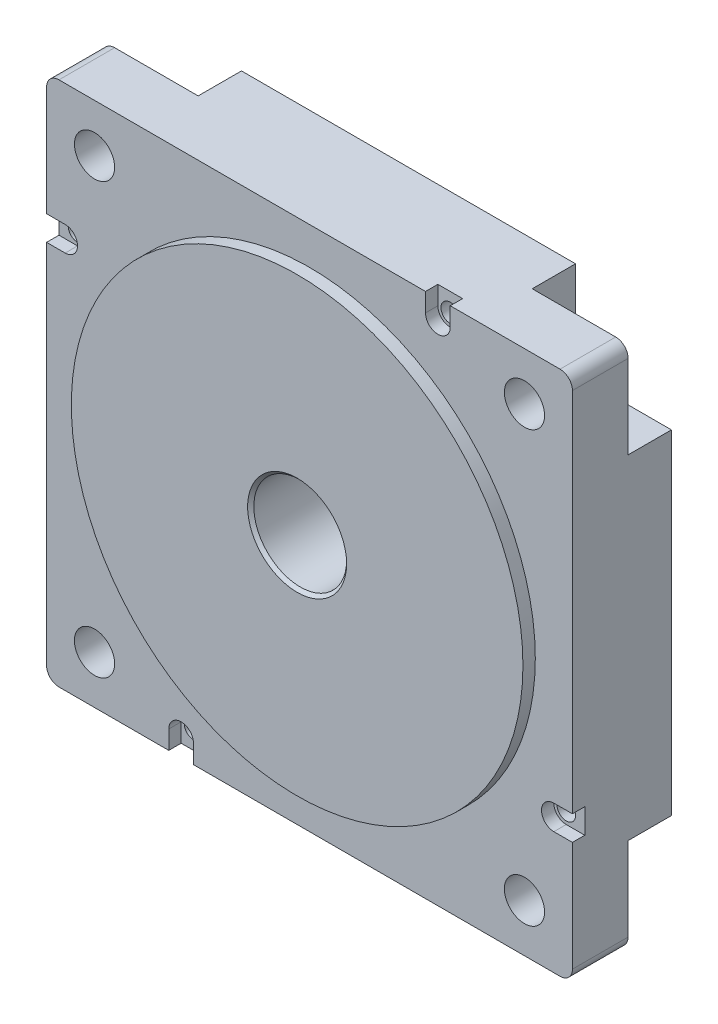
ISO-10303-21;
HEADER;
FILE_DESCRIPTION(('STEP AP214'),'2;1');
FILE_NAME('part.step','',(''),(''),'','','');
FILE_SCHEMA(('AUTOMOTIVE_DESIGN { 1 0 10303 214 1 1 1 1 }'));
ENDSEC;
DATA;
#1=APPLICATION_CONTEXT('core data for automotive mechanical design processes');
#2=APPLICATION_PROTOCOL_DEFINITION('international standard','automotive_design',2000,#1);
#3=PRODUCT_CONTEXT('',#1,'mechanical');
#4=PRODUCT('Part','Part','',(#3));
#5=PRODUCT_RELATED_PRODUCT_CATEGORY('part','',(#4));
#6=PRODUCT_DEFINITION_FORMATION('','',#4);
#7=PRODUCT_DEFINITION_CONTEXT('part definition',#1,'design');
#8=PRODUCT_DEFINITION('design','',#6,#7);
#9=PRODUCT_DEFINITION_SHAPE('','',#8);
#10=(LENGTH_UNIT() NAMED_UNIT(*) SI_UNIT(.MILLI.,.METRE.));
#11=(NAMED_UNIT(*) PLANE_ANGLE_UNIT() SI_UNIT($,.RADIAN.));
#12=(NAMED_UNIT(*) SI_UNIT($,.STERADIAN.) SOLID_ANGLE_UNIT());
#13=UNCERTAINTY_MEASURE_WITH_UNIT(LENGTH_MEASURE(1.E-05),#10,'distance_accuracy_value','');
#14=(GEOMETRIC_REPRESENTATION_CONTEXT(3) GLOBAL_UNCERTAINTY_ASSIGNED_CONTEXT((#13)) GLOBAL_UNIT_ASSIGNED_CONTEXT((#10,
#11,#12)) REPRESENTATION_CONTEXT('',''));
#15=CARTESIAN_POINT('',(0.,0.,0.));
#16=DIRECTION('',(0.,0.,1.));
#17=DIRECTION('',(1.,0.,0.));
#18=AXIS2_PLACEMENT_3D('',#15,#16,#17);
#19=CARTESIAN_POINT('',(32.0000000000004,-31.9999999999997,7.));
#20=DIRECTION('',(0.,0.,-1.));
#21=DIRECTION('',(-1.,0.,0.));
#22=AXIS2_PLACEMENT_3D('',#19,#20,#21);
#23=CYLINDRICAL_SURFACE('',#22,5.);
#24=DIRECTION('',(0.,0.,-1.));
#25=VECTOR('',#24,1.);
#26=CARTESIAN_POINT('',(32.0000000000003,-26.9999999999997,7.));
#27=LINE('',#26,#25);
#28=CARTESIAN_POINT('',(32.0000000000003,-26.9999999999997,7.));
#29=VERTEX_POINT('',#28);
#30=CARTESIAN_POINT('',(32.0000000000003,-26.9999999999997,0.));
#31=VERTEX_POINT('',#30);
#32=EDGE_CURVE('E661',#29,#31,#27,.T.);
#33=ORIENTED_EDGE('',*,*,#32,.F.);
#34=CARTESIAN_POINT('',(32.0000000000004,-31.9999999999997,7.));
#35=DIRECTION('',(0.,0.,-1.));
#36=DIRECTION('',(-1.,0.,0.));
#37=AXIS2_PLACEMENT_3D('',#34,#35,#36);
#38=CIRCLE('',#37,5.);
#39=CARTESIAN_POINT('',(27.0000000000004,-31.9999999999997,7.));
#40=VERTEX_POINT('',#39);
#41=EDGE_CURVE('E44',#40,#29,#38,.T.);
#42=ORIENTED_EDGE('',*,*,#41,.F.);
#43=DIRECTION('',(0.,0.,-1.));
#44=VECTOR('',#43,1.);
#45=CARTESIAN_POINT('',(27.0000000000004,-31.9999999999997,7.));
#46=LINE('',#45,#44);
#47=CARTESIAN_POINT('',(27.0000000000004,-31.9999999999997,0.));
#48=VERTEX_POINT('',#47);
#49=EDGE_CURVE('E663',#48,#40,#46,.F.);
#50=ORIENTED_EDGE('',*,*,#49,.F.);
#51=CARTESIAN_POINT('',(32.0000000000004,-31.9999999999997,0.));
#52=DIRECTION('',(0.,0.,1.));
#53=DIRECTION('',(1.,0.,0.));
#54=AXIS2_PLACEMENT_3D('',#51,#52,#53);
#55=CIRCLE('',#54,5.);
#56=EDGE_CURVE('E11',#48,#31,#55,.F.);
#57=ORIENTED_EDGE('',*,*,#56,.T.);
#58=EDGE_LOOP('',(#33,#42,#50,#57));
#59=FACE_BOUND('',#58,.T.);
#60=ADVANCED_FACE('F37',(#59),#23,.F.);
#61=CARTESIAN_POINT('',(-32.,-32.,7.));
#62=DIRECTION('',(0.,0.,-1.));
#63=DIRECTION('',(-1.,0.,0.));
#64=AXIS2_PLACEMENT_3D('',#61,#62,#63);
#65=CYLINDRICAL_SURFACE('',#64,5.);
#66=DIRECTION('',(0.,0.,-1.));
#67=VECTOR('',#66,1.);
#68=CARTESIAN_POINT('',(-27.,-32.,7.));
#69=LINE('',#68,#67);
#70=CARTESIAN_POINT('',(-27.,-32.,7.));
#71=VERTEX_POINT('',#70);
#72=CARTESIAN_POINT('',(-27.,-32.,0.));
#73=VERTEX_POINT('',#72);
#74=EDGE_CURVE('E651',#71,#73,#69,.T.);
#75=ORIENTED_EDGE('',*,*,#74,.F.);
#76=CARTESIAN_POINT('',(-32.,-32.,7.));
#77=DIRECTION('',(0.,0.,-1.));
#78=DIRECTION('',(-1.,0.,0.));
#79=AXIS2_PLACEMENT_3D('',#76,#77,#78);
#80=CIRCLE('',#79,5.);
#81=CARTESIAN_POINT('',(-32.,-27.,7.));
#82=VERTEX_POINT('',#81);
#83=EDGE_CURVE('E657',#82,#71,#80,.T.);
#84=ORIENTED_EDGE('',*,*,#83,.F.);
#85=DIRECTION('',(0.,0.,-1.));
#86=VECTOR('',#85,1.);
#87=CARTESIAN_POINT('',(-32.,-27.,7.));
#88=LINE('',#87,#86);
#89=CARTESIAN_POINT('',(-32.,-27.,0.));
#90=VERTEX_POINT('',#89);
#91=EDGE_CURVE('E654',#90,#82,#88,.F.);
#92=ORIENTED_EDGE('',*,*,#91,.F.);
#93=CARTESIAN_POINT('',(-32.,-32.,0.));
#94=DIRECTION('',(0.,0.,1.));
#95=DIRECTION('',(1.,0.,0.));
#96=AXIS2_PLACEMENT_3D('',#93,#94,#95);
#97=CIRCLE('',#96,5.);
#98=EDGE_CURVE('E659',#90,#73,#97,.F.);
#99=ORIENTED_EDGE('',*,*,#98,.T.);
#100=EDGE_LOOP('',(#75,#84,#92,#99));
#101=FACE_BOUND('',#100,.T.);
#102=ADVANCED_FACE('F787',(#101),#65,.F.);
#103=CARTESIAN_POINT('',(-32.0000000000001,31.9999999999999,7.));
#104=DIRECTION('',(0.,0.,-1.));
#105=DIRECTION('',(-1.,0.,0.));
#106=AXIS2_PLACEMENT_3D('',#103,#104,#105);
#107=CYLINDRICAL_SURFACE('',#106,5.);
#108=DIRECTION('',(0.,0.,-1.));
#109=VECTOR('',#108,1.);
#110=CARTESIAN_POINT('',(-32.0000000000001,26.9999999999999,7.));
#111=LINE('',#110,#109);
#112=CARTESIAN_POINT('',(-32.0000000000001,26.9999999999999,7.));
#113=VERTEX_POINT('',#112);
#114=CARTESIAN_POINT('',(-32.0000000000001,26.9999999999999,0.));
#115=VERTEX_POINT('',#114);
#116=EDGE_CURVE('E641',#113,#115,#111,.T.);
#117=ORIENTED_EDGE('',*,*,#116,.F.);
#118=CARTESIAN_POINT('',(-32.0000000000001,31.9999999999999,7.));
#119=DIRECTION('',(0.,0.,-1.));
#120=DIRECTION('',(-1.,0.,0.));
#121=AXIS2_PLACEMENT_3D('',#118,#119,#120);
#122=CIRCLE('',#121,5.);
#123=CARTESIAN_POINT('',(-27.0000000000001,31.9999999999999,7.));
#124=VERTEX_POINT('',#123);
#125=EDGE_CURVE('E647',#124,#113,#122,.T.);
#126=ORIENTED_EDGE('',*,*,#125,.F.);
#127=DIRECTION('',(0.,0.,-1.));
#128=VECTOR('',#127,1.);
#129=CARTESIAN_POINT('',(-27.0000000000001,31.9999999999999,7.));
#130=LINE('',#129,#128);
#131=CARTESIAN_POINT('',(-27.0000000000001,31.9999999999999,0.));
#132=VERTEX_POINT('',#131);
#133=EDGE_CURVE('E644',#132,#124,#130,.F.);
#134=ORIENTED_EDGE('',*,*,#133,.F.);
#135=CARTESIAN_POINT('',(-32.0000000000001,31.9999999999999,0.));
#136=DIRECTION('',(0.,0.,1.));
#137=DIRECTION('',(1.,0.,0.));
#138=AXIS2_PLACEMENT_3D('',#135,#136,#137);
#139=CIRCLE('',#138,5.);
#140=EDGE_CURVE('E649',#132,#115,#139,.F.);
#141=ORIENTED_EDGE('',*,*,#140,.T.);
#142=EDGE_LOOP('',(#117,#126,#134,#141));
#143=FACE_BOUND('',#142,.T.);
#144=ADVANCED_FACE('F791',(#143),#107,.F.);
#145=CARTESIAN_POINT('',(0.,0.,0.));
#146=DIRECTION('',(0.,0.,1.));
#147=DIRECTION('',(1.,0.,0.));
#148=AXIS2_PLACEMENT_3D('',#145,#146,#147);
#149=PLANE('',#148);
#150=CARTESIAN_POINT('',(20.75,39.5,0.));
#151=DIRECTION('',(0.,0.,1.));
#152=DIRECTION('',(1.,0.,0.));
#153=AXIS2_PLACEMENT_3D('',#150,#151,#152);
#154=CIRCLE('',#153,1.5);
#155=CARTESIAN_POINT('',(22.25,39.5,0.));
#156=VERTEX_POINT('',#155);
#157=EDGE_CURVE('E406',#156,#156,#154,.T.);
#158=ORIENTED_EDGE('',*,*,#157,.T.);
#159=EDGE_LOOP('',(#158));
#160=FACE_BOUND('',#159,.T.);
#161=CARTESIAN_POINT('',(39.5,-20.75,0.));
#162=DIRECTION('',(0.,0.,1.));
#163=DIRECTION('',(1.,0.,0.));
#164=AXIS2_PLACEMENT_3D('',#161,#162,#163);
#165=CIRCLE('',#164,1.5);
#166=CARTESIAN_POINT('',(41.,-20.75,0.));
#167=VERTEX_POINT('',#166);
#168=EDGE_CURVE('E412',#167,#167,#165,.T.);
#169=ORIENTED_EDGE('',*,*,#168,.T.);
#170=EDGE_LOOP('',(#169));
#171=FACE_BOUND('',#170,.T.);
#172=CARTESIAN_POINT('',(-20.75,-39.5,0.));
#173=DIRECTION('',(0.,0.,1.));
#174=DIRECTION('',(1.,0.,0.));
#175=AXIS2_PLACEMENT_3D('',#172,#173,#174);
#176=CIRCLE('',#175,1.5);
#177=CARTESIAN_POINT('',(-19.25,-39.5,0.));
#178=VERTEX_POINT('',#177);
#179=EDGE_CURVE('E416',#178,#178,#176,.T.);
#180=ORIENTED_EDGE('',*,*,#179,.T.);
#181=EDGE_LOOP('',(#180));
#182=FACE_BOUND('',#181,.T.);
#183=CARTESIAN_POINT('',(-39.5,20.75,0.));
#184=DIRECTION('',(0.,0.,1.));
#185=DIRECTION('',(1.,0.,0.));
#186=AXIS2_PLACEMENT_3D('',#183,#184,#185);
#187=CIRCLE('',#186,1.5);
#188=CARTESIAN_POINT('',(-38.,20.75,0.));
#189=VERTEX_POINT('',#188);
#190=EDGE_CURVE('E420',#189,#189,#187,.T.);
#191=ORIENTED_EDGE('',*,*,#190,.T.);
#192=EDGE_LOOP('',(#191));
#193=FACE_BOUND('',#192,.T.);
#194=CARTESIAN_POINT('',(0.,0.,0.));
#195=DIRECTION('',(0.,0.,1.));
#196=DIRECTION('',(1.,0.,0.));
#197=AXIS2_PLACEMENT_3D('',#194,#195,#196);
#198=CIRCLE('',#197,8.00000000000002);
#199=CARTESIAN_POINT('',(8.00000000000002,0.,0.));
#200=VERTEX_POINT('',#199);
#201=EDGE_CURVE('E592',#200,#200,#198,.T.);
#202=ORIENTED_EDGE('',*,*,#201,.T.);
#203=EDGE_LOOP('',(#202));
#204=FACE_BOUND('',#203,.T.);
#205=DIRECTION('',(-1.,0.,0.));
#206=VECTOR('',#205,1.);
#207=CARTESIAN_POINT('',(2.76766435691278E-13,-27.,0.));
#208=LINE('',#207,#206);
#209=CARTESIAN_POINT('',(42.5000000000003,-26.9999999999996,0.));
#210=VERTEX_POINT('',#209);
#211=EDGE_CURVE('E296',#210,#31,#208,.T.);
#212=ORIENTED_EDGE('',*,*,#211,.T.);
#213=ORIENTED_EDGE('',*,*,#56,.F.);
#214=DIRECTION('',(0.,1.,0.));
#215=VECTOR('',#214,1.);
#216=CARTESIAN_POINT('',(27.,2.82809988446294E-13,0.));
#217=LINE('',#216,#215);
#218=CARTESIAN_POINT('',(27.0000000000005,-42.4999999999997,0.));
#219=VERTEX_POINT('',#218);
#220=EDGE_CURVE('E309',#219,#48,#217,.T.);
#221=ORIENTED_EDGE('',*,*,#220,.F.);
#222=DIRECTION('',(1.,0.,0.));
#223=VECTOR('',#222,1.);
#224=CARTESIAN_POINT('',(42.5,-42.5,0.));
#225=LINE('',#224,#223);
#226=CARTESIAN_POINT('',(-27.,-42.5,0.));
#227=VERTEX_POINT('',#226);
#228=EDGE_CURVE('E552',#227,#219,#225,.T.);
#229=ORIENTED_EDGE('',*,*,#228,.F.);
#230=DIRECTION('',(0.,1.,0.));
#231=VECTOR('',#230,1.);
#232=CARTESIAN_POINT('',(-27.,0.,0.));
#233=LINE('',#232,#231);
#234=EDGE_CURVE('E327',#227,#73,#233,.T.);
#235=ORIENTED_EDGE('',*,*,#234,.T.);
#236=ORIENTED_EDGE('',*,*,#98,.F.);
#237=DIRECTION('',(1.,0.,0.));
#238=VECTOR('',#237,1.);
#239=CARTESIAN_POINT('',(0.,-27.,0.));
#240=LINE('',#239,#238);
#241=CARTESIAN_POINT('',(-42.5,-27.,0.));
#242=VERTEX_POINT('',#241);
#243=EDGE_CURVE('E333',#242,#90,#240,.T.);
#244=ORIENTED_EDGE('',*,*,#243,.F.);
#245=DIRECTION('',(0.,-1.,0.));
#246=VECTOR('',#245,1.);
#247=CARTESIAN_POINT('',(-42.5,37.5,0.));
#248=LINE('',#247,#246);
#249=CARTESIAN_POINT('',(-42.5000000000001,26.9999999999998,0.));
#250=VERTEX_POINT('',#249);
#251=EDGE_CURVE('E573',#250,#242,#248,.T.);
#252=ORIENTED_EDGE('',*,*,#251,.F.);
#253=DIRECTION('',(1.,0.,0.));
#254=VECTOR('',#253,1.);
#255=CARTESIAN_POINT('',(0.,27.,0.));
#256=LINE('',#255,#254);
#257=EDGE_CURVE('E350',#250,#115,#256,.T.);
#258=ORIENTED_EDGE('',*,*,#257,.T.);
#259=ORIENTED_EDGE('',*,*,#140,.F.);
#260=DIRECTION('',(0.,-1.,0.));
#261=VECTOR('',#260,1.);
#262=CARTESIAN_POINT('',(-27.,0.,0.));
#263=LINE('',#262,#261);
#264=CARTESIAN_POINT('',(-27.0000000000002,42.4999999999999,0.));
#265=VERTEX_POINT('',#264);
#266=EDGE_CURVE('E357',#265,#132,#263,.T.);
#267=ORIENTED_EDGE('',*,*,#266,.F.);
#268=DIRECTION('',(-1.,0.,0.));
#269=VECTOR('',#268,1.);
#270=CARTESIAN_POINT('',(-37.5,42.5,0.));
#271=LINE('',#270,#269);
#272=CARTESIAN_POINT('',(27.,42.5,0.));
#273=VERTEX_POINT('',#272);
#274=EDGE_CURVE('E570',#273,#265,#271,.T.);
#275=ORIENTED_EDGE('',*,*,#274,.F.);
#276=DIRECTION('',(0.,-1.,0.));
#277=VECTOR('',#276,1.);
#278=CARTESIAN_POINT('',(27.,0.,0.));
#279=LINE('',#278,#277);
#280=CARTESIAN_POINT('',(27.,32.,0.));
#281=VERTEX_POINT('',#280);
#282=EDGE_CURVE('E374',#273,#281,#279,.T.);
#283=ORIENTED_EDGE('',*,*,#282,.T.);
#284=CARTESIAN_POINT('',(32.,32.,0.));
#285=DIRECTION('',(0.,0.,1.));
#286=DIRECTION('',(1.,0.,0.));
#287=AXIS2_PLACEMENT_3D('',#284,#285,#286);
#288=CIRCLE('',#287,5.);
#289=CARTESIAN_POINT('',(32.,27.,0.));
#290=VERTEX_POINT('',#289);
#291=EDGE_CURVE('E603',#290,#281,#288,.F.);
#292=ORIENTED_EDGE('',*,*,#291,.F.);
#293=DIRECTION('',(-1.,0.,0.));
#294=VECTOR('',#293,1.);
#295=CARTESIAN_POINT('',(0.,27.,0.));
#296=LINE('',#295,#294);
#297=CARTESIAN_POINT('',(42.5,27.,0.));
#298=VERTEX_POINT('',#297);
#299=EDGE_CURVE('E381',#298,#290,#296,.T.);
#300=ORIENTED_EDGE('',*,*,#299,.F.);
#301=DIRECTION('',(0.,1.,0.));
#302=VECTOR('',#301,1.);
#303=CARTESIAN_POINT('',(42.5,42.5,0.));
#304=LINE('',#303,#302);
#305=EDGE_CURVE('E568',#210,#298,#304,.T.);
#306=ORIENTED_EDGE('',*,*,#305,.F.);
#307=EDGE_LOOP('',(#212,#213,#221,#229,#235,#236,#244,#252,#258,#259,#267,#275,#283,#292,#300,#306));
#308=FACE_BOUND('',#307,.T.);
#309=ADVANCED_FACE('F717',(#160,#171,#182,#193,#204,#308),#149,.F.);
#310=CARTESIAN_POINT('',(42.5,42.5,16.));
#311=DIRECTION('',(-1.,0.,0.));
#312=DIRECTION('',(0.,0.,1.));
#313=AXIS2_PLACEMENT_3D('',#310,#311,#312);
#314=PLANE('',#313);
#315=DIRECTION('',(0.,0.,-1.));
#316=VECTOR('',#315,1.);
#317=CARTESIAN_POINT('',(42.5000000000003,-26.9999999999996,7.));
#318=LINE('',#317,#316);
#319=CARTESIAN_POINT('',(42.5000000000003,-26.9999999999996,7.));
#320=VERTEX_POINT('',#319);
#321=EDGE_CURVE('E291',#320,#210,#318,.T.);
#322=ORIENTED_EDGE('',*,*,#321,.T.);
#323=ORIENTED_EDGE('',*,*,#305,.T.);
#324=DIRECTION('',(0.,0.,-1.));
#325=VECTOR('',#324,1.);
#326=CARTESIAN_POINT('',(42.5,27.,7.));
#327=LINE('',#326,#325);
#328=CARTESIAN_POINT('',(42.5,27.,7.));
#329=VERTEX_POINT('',#328);
#330=EDGE_CURVE('E397',#329,#298,#327,.T.);
#331=ORIENTED_EDGE('',*,*,#330,.F.);
#332=DIRECTION('',(0.,-1.,0.));
#333=VECTOR('',#332,1.);
#334=CARTESIAN_POINT('',(42.5,0.,7.));
#335=LINE('',#334,#333);
#336=CARTESIAN_POINT('',(42.5,40.5,7.));
#337=VERTEX_POINT('',#336);
#338=EDGE_CURVE('E384',#337,#329,#335,.T.);
#339=ORIENTED_EDGE('',*,*,#338,.F.);
#340=DIRECTION('',(0.,0.,-1.));
#341=VECTOR('',#340,1.);
#342=CARTESIAN_POINT('',(42.5,40.5,16.));
#343=LINE('',#342,#341);
#344=CARTESIAN_POINT('',(42.5,40.5,16.));
#345=VERTEX_POINT('',#344);
#346=EDGE_CURVE('E605',#337,#345,#343,.F.);
#347=ORIENTED_EDGE('',*,*,#346,.T.);
#348=DIRECTION('',(0.,1.,0.));
#349=VECTOR('',#348,1.);
#350=CARTESIAN_POINT('',(42.5,-37.5,16.));
#351=LINE('',#350,#349);
#352=CARTESIAN_POINT('',(42.5,-18.75,16.));
#353=VERTEX_POINT('',#352);
#354=EDGE_CURVE('E559',#353,#345,#351,.T.);
#355=ORIENTED_EDGE('',*,*,#354,.F.);
#356=DIRECTION('',(0.,0.,1.));
#357=VECTOR('',#356,1.);
#358=CARTESIAN_POINT('',(42.5,-18.75,14.));
#359=LINE('',#358,#357);
#360=CARTESIAN_POINT('',(42.5,-18.75,14.));
#361=VERTEX_POINT('',#360);
#362=EDGE_CURVE('E436',#361,#353,#359,.T.);
#363=ORIENTED_EDGE('',*,*,#362,.F.);
#364=DIRECTION('',(0.,1.,0.));
#365=VECTOR('',#364,1.);
#366=CARTESIAN_POINT('',(42.5,-18.75,14.));
#367=LINE('',#366,#365);
#368=CARTESIAN_POINT('',(42.5,-22.75,14.));
#369=VERTEX_POINT('',#368);
#370=EDGE_CURVE('E424',#369,#361,#367,.T.);
#371=ORIENTED_EDGE('',*,*,#370,.F.);
#372=DIRECTION('',(0.,0.,1.));
#373=VECTOR('',#372,1.);
#374=CARTESIAN_POINT('',(42.5,-22.75,14.));
#375=LINE('',#374,#373);
#376=CARTESIAN_POINT('',(42.5,-22.75,16.));
#377=VERTEX_POINT('',#376);
#378=EDGE_CURVE('E445',#369,#377,#375,.T.);
#379=ORIENTED_EDGE('',*,*,#378,.T.);
#380=CARTESIAN_POINT('',(42.5,-40.5,16.));
#381=VERTEX_POINT('',#380);
#382=EDGE_CURVE('E560',#381,#377,#351,.T.);
#383=ORIENTED_EDGE('',*,*,#382,.F.);
#384=DIRECTION('',(0.,0.,-1.));
#385=VECTOR('',#384,1.);
#386=CARTESIAN_POINT('',(42.5,-40.5,16.));
#387=LINE('',#386,#385);
#388=CARTESIAN_POINT('',(42.5,-40.5,7.));
#389=VERTEX_POINT('',#388);
#390=EDGE_CURVE('E315',#381,#389,#387,.T.);
#391=ORIENTED_EDGE('',*,*,#390,.T.);
#392=DIRECTION('',(0.,-1.,0.));
#393=VECTOR('',#392,1.);
#394=CARTESIAN_POINT('',(42.5,4.451638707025E-13,7.));
#395=LINE('',#394,#393);
#396=EDGE_CURVE('E307',#320,#389,#395,.T.);
#397=ORIENTED_EDGE('',*,*,#396,.F.);
#398=EDGE_LOOP('',(#322,#323,#331,#339,#347,#355,#363,#371,#379,#383,#391,#397));
#399=FACE_BOUND('',#398,.T.);
#400=ADVANCED_FACE('F312',(#399),#314,.F.);
#401=CARTESIAN_POINT('',(34.75,-34.75,16.));
#402=DIRECTION('',(0.,0.,-1.));
#403=DIRECTION('',(-1.,0.,0.));
#404=AXIS2_PLACEMENT_3D('',#401,#402,#403);
#405=CYLINDRICAL_SURFACE('',#404,3.25);
#406=CARTESIAN_POINT('',(34.75,-34.75,16.));
#407=DIRECTION('',(0.,0.,1.));
#408=DIRECTION('',(1.,0.,0.));
#409=AXIS2_PLACEMENT_3D('',#406,#407,#408);
#410=CIRCLE('',#409,3.25);
#411=CARTESIAN_POINT('',(38.,-34.75,16.));
#412=VERTEX_POINT('',#411);
#413=EDGE_CURVE('E543',#412,#412,#410,.T.);
#414=ORIENTED_EDGE('',*,*,#413,.T.);
#415=EDGE_LOOP('',(#414));
#416=FACE_BOUND('',#415,.T.);
#417=CARTESIAN_POINT('',(34.7500000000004,-34.7499999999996,7.));
#418=DIRECTION('',(0.,0.,-1.));
#419=DIRECTION('',(0.,1.,0.));
#420=AXIS2_PLACEMENT_3D('',#417,#418,#419);
#421=CIRCLE('',#420,3.25);
#422=CARTESIAN_POINT('',(34.7500000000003,-31.4999999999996,7.));
#423=VERTEX_POINT('',#422);
#424=EDGE_CURVE('E301',#423,#423,#421,.F.);
#425=ORIENTED_EDGE('',*,*,#424,.F.);
#426=EDGE_LOOP('',(#425));
#427=FACE_BOUND('',#426,.T.);
#428=ADVANCED_FACE('F817',(#416,#427),#405,.F.);
#429=CARTESIAN_POINT('',(40.5,-40.5,16.));
#430=DIRECTION('',(0.,0.,-1.));
#431=DIRECTION('',(-1.,0.,0.));
#432=AXIS2_PLACEMENT_3D('',#429,#430,#431);
#433=CYLINDRICAL_SURFACE('',#432,2.);
#434=DIRECTION('',(0.,0.,-1.));
#435=VECTOR('',#434,1.);
#436=CARTESIAN_POINT('',(40.5,-42.5,16.));
#437=LINE('',#436,#435);
#438=CARTESIAN_POINT('',(40.5,-42.4999999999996,7.));
#439=VERTEX_POINT('',#438);
#440=CARTESIAN_POINT('',(40.5,-42.4999999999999,16.));
#441=VERTEX_POINT('',#440);
#442=EDGE_CURVE('E611',#439,#441,#437,.F.);
#443=ORIENTED_EDGE('',*,*,#442,.F.);
#444=CARTESIAN_POINT('',(40.5,-40.5,7.));
#445=DIRECTION('',(0.,0.,-1.));
#446=DIRECTION('',(-1.,0.,0.));
#447=AXIS2_PLACEMENT_3D('',#444,#445,#446);
#448=CIRCLE('',#447,2.);
#449=EDGE_CURVE('E639',#439,#389,#448,.F.);
#450=ORIENTED_EDGE('',*,*,#449,.T.);
#451=ORIENTED_EDGE('',*,*,#390,.F.);
#452=CARTESIAN_POINT('',(40.5,-40.5,16.));
#453=DIRECTION('',(0.,0.,1.));
#454=DIRECTION('',(1.,0.,0.));
#455=AXIS2_PLACEMENT_3D('',#452,#453,#454);
#456=CIRCLE('',#455,2.);
#457=EDGE_CURVE('E619',#441,#381,#456,.T.);
#458=ORIENTED_EDGE('',*,*,#457,.F.);
#459=EDGE_LOOP('',(#443,#450,#451,#458));
#460=FACE_BOUND('',#459,.T.);
#461=ADVANCED_FACE('F676',(#460),#433,.T.);
#462=CARTESIAN_POINT('',(42.5,-42.5,16.));
#463=DIRECTION('',(0.,1.,0.));
#464=DIRECTION('',(0.,0.,1.));
#465=AXIS2_PLACEMENT_3D('',#462,#463,#464);
#466=PLANE('',#465);
#467=ORIENTED_EDGE('',*,*,#228,.T.);
#468=DIRECTION('',(0.,0.,-1.));
#469=VECTOR('',#468,1.);
#470=CARTESIAN_POINT('',(27.0000000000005,-42.4999999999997,7.));
#471=LINE('',#470,#469);
#472=CARTESIAN_POINT('',(27.0000000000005,-42.4999999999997,7.));
#473=VERTEX_POINT('',#472);
#474=EDGE_CURVE('E300',#473,#219,#471,.T.);
#475=ORIENTED_EDGE('',*,*,#474,.F.);
#476=DIRECTION('',(-1.,0.,0.));
#477=VECTOR('',#476,1.);
#478=CARTESIAN_POINT('',(4.45163870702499E-13,-42.5,7.));
#479=LINE('',#478,#477);
#480=EDGE_CURVE('E316',#439,#473,#479,.T.);
#481=ORIENTED_EDGE('',*,*,#480,.F.);
#482=ORIENTED_EDGE('',*,*,#442,.T.);
#483=DIRECTION('',(1.,0.,0.));
#484=VECTOR('',#483,1.);
#485=CARTESIAN_POINT('',(-37.5,-42.5,16.));
#486=LINE('',#485,#484);
#487=CARTESIAN_POINT('',(-18.75,-42.5,16.));
#488=VERTEX_POINT('',#487);
#489=EDGE_CURVE('E555',#488,#441,#486,.T.);
#490=ORIENTED_EDGE('',*,*,#489,.F.);
#491=DIRECTION('',(0.,0.,1.));
#492=VECTOR('',#491,1.);
#493=CARTESIAN_POINT('',(-18.75,-42.5,14.));
#494=LINE('',#493,#492);
#495=CARTESIAN_POINT('',(-18.75,-42.5,14.));
#496=VERTEX_POINT('',#495);
#497=EDGE_CURVE('E495',#496,#488,#494,.T.);
#498=ORIENTED_EDGE('',*,*,#497,.F.);
#499=DIRECTION('',(1.,0.,0.));
#500=VECTOR('',#499,1.);
#501=CARTESIAN_POINT('',(-18.75,-42.5,14.));
#502=LINE('',#501,#500);
#503=CARTESIAN_POINT('',(-22.75,-42.5,14.));
#504=VERTEX_POINT('',#503);
#505=EDGE_CURVE('E483',#504,#496,#502,.T.);
#506=ORIENTED_EDGE('',*,*,#505,.F.);
#507=DIRECTION('',(0.,0.,1.));
#508=VECTOR('',#507,1.);
#509=CARTESIAN_POINT('',(-22.75,-42.5,14.));
#510=LINE('',#509,#508);
#511=CARTESIAN_POINT('',(-22.75,-42.5,16.));
#512=VERTEX_POINT('',#511);
#513=EDGE_CURVE('E503',#504,#512,#510,.T.);
#514=ORIENTED_EDGE('',*,*,#513,.T.);
#515=CARTESIAN_POINT('',(-40.5,-42.5,16.));
#516=VERTEX_POINT('',#515);
#517=EDGE_CURVE('E557',#516,#512,#486,.T.);
#518=ORIENTED_EDGE('',*,*,#517,.F.);
#519=DIRECTION('',(0.,0.,-1.));
#520=VECTOR('',#519,1.);
#521=CARTESIAN_POINT('',(-40.5,-42.5,16.));
#522=LINE('',#521,#520);
#523=CARTESIAN_POINT('',(-40.5,-42.5,7.));
#524=VERTEX_POINT('',#523);
#525=EDGE_CURVE('E608',#516,#524,#522,.T.);
#526=ORIENTED_EDGE('',*,*,#525,.T.);
#527=DIRECTION('',(-1.,0.,0.));
#528=VECTOR('',#527,1.);
#529=CARTESIAN_POINT('',(0.,-42.5,7.));
#530=LINE('',#529,#528);
#531=CARTESIAN_POINT('',(-27.,-42.5,7.));
#532=VERTEX_POINT('',#531);
#533=EDGE_CURVE('E332',#532,#524,#530,.T.);
#534=ORIENTED_EDGE('',*,*,#533,.F.);
#535=DIRECTION('',(0.,0.,-1.));
#536=VECTOR('',#535,1.);
#537=CARTESIAN_POINT('',(-27.,-42.5,7.));
#538=LINE('',#537,#536);
#539=EDGE_CURVE('E343',#532,#227,#538,.T.);
#540=ORIENTED_EDGE('',*,*,#539,.T.);
#541=EDGE_LOOP('',(#467,#475,#481,#482,#490,#498,#506,#514,#518,#526,#534,#540));
#542=FACE_BOUND('',#541,.T.);
#543=ADVANCED_FACE('F671',(#542),#466,.F.);
#544=CARTESIAN_POINT('',(-34.75,-34.75,16.));
#545=DIRECTION('',(0.,0.,-1.));
#546=DIRECTION('',(-1.,0.,0.));
#547=AXIS2_PLACEMENT_3D('',#544,#545,#546);
#548=CYLINDRICAL_SURFACE('',#547,3.25);
#549=CARTESIAN_POINT('',(-34.75,-34.75,16.));
#550=DIRECTION('',(0.,0.,1.));
#551=DIRECTION('',(1.,0.,0.));
#552=AXIS2_PLACEMENT_3D('',#549,#550,#551);
#553=CIRCLE('',#552,3.25);
#554=CARTESIAN_POINT('',(-31.5,-34.75,16.));
#555=VERTEX_POINT('',#554);
#556=EDGE_CURVE('E546',#555,#555,#553,.T.);
#557=ORIENTED_EDGE('',*,*,#556,.T.);
#558=EDGE_LOOP('',(#557));
#559=FACE_BOUND('',#558,.T.);
#560=CARTESIAN_POINT('',(-34.75,-34.75,7.));
#561=DIRECTION('',(0.,0.,-1.));
#562=DIRECTION('',(1.,0.,0.));
#563=AXIS2_PLACEMENT_3D('',#560,#561,#562);
#564=CIRCLE('',#563,3.25);
#565=CARTESIAN_POINT('',(-31.5,-34.75,7.));
#566=VERTEX_POINT('',#565);
#567=EDGE_CURVE('E340',#566,#566,#564,.F.);
#568=ORIENTED_EDGE('',*,*,#567,.F.);
#569=EDGE_LOOP('',(#568));
#570=FACE_BOUND('',#569,.T.);
#571=ADVANCED_FACE('F819',(#559,#570),#548,.F.);
#572=CARTESIAN_POINT('',(-40.5,-40.5,16.));
#573=DIRECTION('',(0.,0.,-1.));
#574=DIRECTION('',(-1.,0.,0.));
#575=AXIS2_PLACEMENT_3D('',#572,#573,#574);
#576=CYLINDRICAL_SURFACE('',#575,2.);
#577=DIRECTION('',(0.,0.,-1.));
#578=VECTOR('',#577,1.);
#579=CARTESIAN_POINT('',(-42.5,-40.5,16.));
#580=LINE('',#579,#578);
#581=CARTESIAN_POINT('',(-42.5,-40.5,7.));
#582=VERTEX_POINT('',#581);
#583=CARTESIAN_POINT('',(-42.5,-40.5,16.));
#584=VERTEX_POINT('',#583);
#585=EDGE_CURVE('E624',#582,#584,#580,.F.);
#586=ORIENTED_EDGE('',*,*,#585,.F.);
#587=CARTESIAN_POINT('',(-40.5,-40.5,7.));
#588=DIRECTION('',(0.,0.,-1.));
#589=DIRECTION('',(-1.,0.,0.));
#590=AXIS2_PLACEMENT_3D('',#587,#588,#589);
#591=CIRCLE('',#590,2.);
#592=EDGE_CURVE('E636',#582,#524,#591,.F.);
#593=ORIENTED_EDGE('',*,*,#592,.T.);
#594=ORIENTED_EDGE('',*,*,#525,.F.);
#595=CARTESIAN_POINT('',(-40.5,-40.5,16.));
#596=DIRECTION('',(0.,0.,1.));
#597=DIRECTION('',(1.,0.,0.));
#598=AXIS2_PLACEMENT_3D('',#595,#596,#597);
#599=CIRCLE('',#598,2.);
#600=EDGE_CURVE('E617',#584,#516,#599,.T.);
#601=ORIENTED_EDGE('',*,*,#600,.F.);
#602=EDGE_LOOP('',(#586,#593,#594,#601));
#603=FACE_BOUND('',#602,.T.);
#604=ADVANCED_FACE('F758',(#603),#576,.T.);
#605=CARTESIAN_POINT('',(-42.5,37.5,16.));
#606=DIRECTION('',(1.,0.,0.));
#607=DIRECTION('',(0.,1.,0.));
#608=AXIS2_PLACEMENT_3D('',#605,#606,#607);
#609=PLANE('',#608);
#610=ORIENTED_EDGE('',*,*,#251,.T.);
#611=DIRECTION('',(0.,0.,-1.));
#612=VECTOR('',#611,1.);
#613=CARTESIAN_POINT('',(-42.5,-27.,7.));
#614=LINE('',#613,#612);
#615=CARTESIAN_POINT('',(-42.5,-27.,7.));
#616=VERTEX_POINT('',#615);
#617=EDGE_CURVE('E348',#616,#242,#614,.T.);
#618=ORIENTED_EDGE('',*,*,#617,.F.);
#619=DIRECTION('',(0.,1.,0.));
#620=VECTOR('',#619,1.);
#621=CARTESIAN_POINT('',(-42.5,0.,7.));
#622=LINE('',#621,#620);
#623=EDGE_CURVE('E335',#582,#616,#622,.T.);
#624=ORIENTED_EDGE('',*,*,#623,.F.);
#625=ORIENTED_EDGE('',*,*,#585,.T.);
#626=DIRECTION('',(0.,-1.,0.));
#627=VECTOR('',#626,1.);
#628=CARTESIAN_POINT('',(-42.5,-42.5,16.));
#629=LINE('',#628,#627);
#630=CARTESIAN_POINT('',(-42.5,18.75,16.));
#631=VERTEX_POINT('',#630);
#632=EDGE_CURVE('E556',#631,#584,#629,.T.);
#633=ORIENTED_EDGE('',*,*,#632,.F.);
#634=DIRECTION('',(0.,0.,1.));
#635=VECTOR('',#634,1.);
#636=CARTESIAN_POINT('',(-42.5,18.75,14.));
#637=LINE('',#636,#635);
#638=CARTESIAN_POINT('',(-42.5,18.75,14.));
#639=VERTEX_POINT('',#638);
#640=EDGE_CURVE('E466',#639,#631,#637,.T.);
#641=ORIENTED_EDGE('',*,*,#640,.F.);
#642=DIRECTION('',(0.,-1.,0.));
#643=VECTOR('',#642,1.);
#644=CARTESIAN_POINT('',(-42.5,18.75,14.));
#645=LINE('',#644,#643);
#646=CARTESIAN_POINT('',(-42.5,22.75,14.));
#647=VERTEX_POINT('',#646);
#648=EDGE_CURVE('E454',#647,#639,#645,.T.);
#649=ORIENTED_EDGE('',*,*,#648,.F.);
#650=DIRECTION('',(0.,0.,1.));
#651=VECTOR('',#650,1.);
#652=CARTESIAN_POINT('',(-42.5,22.75,14.));
#653=LINE('',#652,#651);
#654=CARTESIAN_POINT('',(-42.5,22.75,16.));
#655=VERTEX_POINT('',#654);
#656=EDGE_CURVE('E474',#647,#655,#653,.T.);
#657=ORIENTED_EDGE('',*,*,#656,.T.);
#658=CARTESIAN_POINT('',(-42.5,40.5,16.));
#659=VERTEX_POINT('',#658);
#660=EDGE_CURVE('E553',#659,#655,#629,.T.);
#661=ORIENTED_EDGE('',*,*,#660,.F.);
#662=DIRECTION('',(0.,0.,-1.));
#663=VECTOR('',#662,1.);
#664=CARTESIAN_POINT('',(-42.5,40.5,16.));
#665=LINE('',#664,#663);
#666=CARTESIAN_POINT('',(-42.5,40.5,7.));
#667=VERTEX_POINT('',#666);
#668=EDGE_CURVE('E621',#659,#667,#665,.T.);
#669=ORIENTED_EDGE('',*,*,#668,.T.);
#670=DIRECTION('',(0.,1.,0.));
#671=VECTOR('',#670,1.);
#672=CARTESIAN_POINT('',(-42.5,-1.48387956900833E-13,7.));
#673=LINE('',#672,#671);
#674=CARTESIAN_POINT('',(-42.5000000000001,26.9999999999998,7.));
#675=VERTEX_POINT('',#674);
#676=EDGE_CURVE('E356',#675,#667,#673,.T.);
#677=ORIENTED_EDGE('',*,*,#676,.F.);
#678=DIRECTION('',(0.,0.,-1.));
#679=VECTOR('',#678,1.);
#680=CARTESIAN_POINT('',(-42.5000000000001,26.9999999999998,7.));
#681=LINE('',#680,#679);
#682=EDGE_CURVE('E367',#675,#250,#681,.T.);
#683=ORIENTED_EDGE('',*,*,#682,.T.);
#684=EDGE_LOOP('',(#610,#618,#624,#625,#633,#641,#649,#657,#661,#669,#677,#683));
#685=FACE_BOUND('',#684,.T.);
#686=ADVANCED_FACE('F735',(#685),#609,.F.);
#687=CARTESIAN_POINT('',(-34.75,34.75,16.));
#688=DIRECTION('',(0.,0.,-1.));
#689=DIRECTION('',(-1.,0.,0.));
#690=AXIS2_PLACEMENT_3D('',#687,#688,#689);
#691=CYLINDRICAL_SURFACE('',#690,3.25);
#692=CARTESIAN_POINT('',(-34.75,34.75,16.));
#693=DIRECTION('',(0.,0.,1.));
#694=DIRECTION('',(1.,0.,0.));
#695=AXIS2_PLACEMENT_3D('',#692,#693,#694);
#696=CIRCLE('',#695,3.25);
#697=CARTESIAN_POINT('',(-31.5,34.75,16.));
#698=VERTEX_POINT('',#697);
#699=EDGE_CURVE('E549',#698,#698,#696,.T.);
#700=ORIENTED_EDGE('',*,*,#699,.T.);
#701=EDGE_LOOP('',(#700));
#702=FACE_BOUND('',#701,.T.);
#703=CARTESIAN_POINT('',(-34.7500000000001,34.7499999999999,7.));
#704=DIRECTION('',(0.,0.,-1.));
#705=DIRECTION('',(0.,-1.,0.));
#706=AXIS2_PLACEMENT_3D('',#703,#704,#705);
#707=CIRCLE('',#706,3.25);
#708=CARTESIAN_POINT('',(-34.7500000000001,31.4999999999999,7.));
#709=VERTEX_POINT('',#708);
#710=EDGE_CURVE('E364',#709,#709,#707,.F.);
#711=ORIENTED_EDGE('',*,*,#710,.F.);
#712=EDGE_LOOP('',(#711));
#713=FACE_BOUND('',#712,.T.);
#714=ADVANCED_FACE('F809',(#702,#713),#691,.F.);
#715=CARTESIAN_POINT('',(-40.5,40.5,16.));
#716=DIRECTION('',(0.,0.,-1.));
#717=DIRECTION('',(-1.,0.,0.));
#718=AXIS2_PLACEMENT_3D('',#715,#716,#717);
#719=CYLINDRICAL_SURFACE('',#718,2.);
#720=DIRECTION('',(0.,0.,-1.));
#721=VECTOR('',#720,1.);
#722=CARTESIAN_POINT('',(-40.5,42.5,16.));
#723=LINE('',#722,#721);
#724=CARTESIAN_POINT('',(-40.5,42.4999999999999,7.));
#725=VERTEX_POINT('',#724);
#726=CARTESIAN_POINT('',(-40.5,42.5,16.));
#727=VERTEX_POINT('',#726);
#728=EDGE_CURVE('E629',#725,#727,#723,.F.);
#729=ORIENTED_EDGE('',*,*,#728,.F.);
#730=CARTESIAN_POINT('',(-40.5,40.5,7.));
#731=DIRECTION('',(0.,0.,-1.));
#732=DIRECTION('',(-1.,0.,0.));
#733=AXIS2_PLACEMENT_3D('',#730,#731,#732);
#734=CIRCLE('',#733,2.);
#735=EDGE_CURVE('E633',#725,#667,#734,.F.);
#736=ORIENTED_EDGE('',*,*,#735,.T.);
#737=ORIENTED_EDGE('',*,*,#668,.F.);
#738=CARTESIAN_POINT('',(-40.5,40.5,16.));
#739=DIRECTION('',(0.,0.,1.));
#740=DIRECTION('',(1.,0.,0.));
#741=AXIS2_PLACEMENT_3D('',#738,#739,#740);
#742=CIRCLE('',#741,2.);
#743=EDGE_CURVE('E615',#727,#659,#742,.T.);
#744=ORIENTED_EDGE('',*,*,#743,.F.);
#745=EDGE_LOOP('',(#729,#736,#737,#744));
#746=FACE_BOUND('',#745,.T.);
#747=ADVANCED_FACE('F729',(#746),#719,.T.);
#748=CARTESIAN_POINT('',(32.,32.,7.));
#749=DIRECTION('',(0.,0.,-1.));
#750=DIRECTION('',(-1.,0.,0.));
#751=AXIS2_PLACEMENT_3D('',#748,#749,#750);
#752=CYLINDRICAL_SURFACE('',#751,5.);
#753=DIRECTION('',(0.,0.,-1.));
#754=VECTOR('',#753,1.);
#755=CARTESIAN_POINT('',(27.,32.,7.));
#756=LINE('',#755,#754);
#757=CARTESIAN_POINT('',(27.,32.,7.));
#758=VERTEX_POINT('',#757);
#759=EDGE_CURVE('E595',#758,#281,#756,.T.);
#760=ORIENTED_EDGE('',*,*,#759,.F.);
#761=CARTESIAN_POINT('',(32.,32.,7.));
#762=DIRECTION('',(0.,0.,-1.));
#763=DIRECTION('',(-1.,0.,0.));
#764=AXIS2_PLACEMENT_3D('',#761,#762,#763);
#765=CIRCLE('',#764,5.);
#766=CARTESIAN_POINT('',(32.,27.,7.));
#767=VERTEX_POINT('',#766);
#768=EDGE_CURVE('E601',#767,#758,#765,.T.);
#769=ORIENTED_EDGE('',*,*,#768,.F.);
#770=DIRECTION('',(0.,0.,-1.));
#771=VECTOR('',#770,1.);
#772=CARTESIAN_POINT('',(32.,27.,7.));
#773=LINE('',#772,#771);
#774=EDGE_CURVE('E598',#290,#767,#773,.F.);
#775=ORIENTED_EDGE('',*,*,#774,.F.);
#776=ORIENTED_EDGE('',*,*,#291,.T.);
#777=EDGE_LOOP('',(#760,#769,#775,#776));
#778=FACE_BOUND('',#777,.T.);
#779=ADVANCED_FACE('F800',(#778),#752,.F.);
#780=CARTESIAN_POINT('',(-37.5,42.5,16.));
#781=DIRECTION('',(0.,-1.,0.));
#782=DIRECTION('',(0.,0.,-1.));
#783=AXIS2_PLACEMENT_3D('',#780,#781,#782);
#784=PLANE('',#783);
#785=ORIENTED_EDGE('',*,*,#274,.T.);
#786=DIRECTION('',(0.,0.,-1.));
#787=VECTOR('',#786,1.);
#788=CARTESIAN_POINT('',(-27.0000000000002,42.4999999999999,7.));
#789=LINE('',#788,#787);
#790=CARTESIAN_POINT('',(-27.0000000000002,42.4999999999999,7.));
#791=VERTEX_POINT('',#790);
#792=EDGE_CURVE('E372',#791,#265,#789,.T.);
#793=ORIENTED_EDGE('',*,*,#792,.F.);
#794=DIRECTION('',(1.,0.,0.));
#795=VECTOR('',#794,1.);
#796=CARTESIAN_POINT('',(-1.48387956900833E-13,42.5,7.));
#797=LINE('',#796,#795);
#798=EDGE_CURVE('E359',#725,#791,#797,.T.);
#799=ORIENTED_EDGE('',*,*,#798,.F.);
#800=ORIENTED_EDGE('',*,*,#728,.T.);
#801=DIRECTION('',(-1.,0.,0.));
#802=VECTOR('',#801,1.);
#803=CARTESIAN_POINT('',(37.5,42.5,16.));
#804=LINE('',#803,#802);
#805=CARTESIAN_POINT('',(18.75,42.5,16.));
#806=VERTEX_POINT('',#805);
#807=EDGE_CURVE('E562',#806,#727,#804,.T.);
#808=ORIENTED_EDGE('',*,*,#807,.F.);
#809=DIRECTION('',(0.,0.,1.));
#810=VECTOR('',#809,1.);
#811=CARTESIAN_POINT('',(18.75,42.5,14.));
#812=LINE('',#811,#810);
#813=CARTESIAN_POINT('',(18.75,42.5,14.));
#814=VERTEX_POINT('',#813);
#815=EDGE_CURVE('E524',#814,#806,#812,.T.);
#816=ORIENTED_EDGE('',*,*,#815,.F.);
#817=DIRECTION('',(-1.,0.,0.));
#818=VECTOR('',#817,1.);
#819=CARTESIAN_POINT('',(18.75,42.5,14.));
#820=LINE('',#819,#818);
#821=CARTESIAN_POINT('',(22.75,42.5,14.));
#822=VERTEX_POINT('',#821);
#823=EDGE_CURVE('E512',#822,#814,#820,.T.);
#824=ORIENTED_EDGE('',*,*,#823,.F.);
#825=DIRECTION('',(0.,0.,1.));
#826=VECTOR('',#825,1.);
#827=CARTESIAN_POINT('',(22.75,42.5,14.));
#828=LINE('',#827,#826);
#829=CARTESIAN_POINT('',(22.75,42.5,16.));
#830=VERTEX_POINT('',#829);
#831=EDGE_CURVE('E532',#822,#830,#828,.T.);
#832=ORIENTED_EDGE('',*,*,#831,.T.);
#833=CARTESIAN_POINT('',(40.5,42.5,16.));
#834=VERTEX_POINT('',#833);
#835=EDGE_CURVE('E563',#834,#830,#804,.T.);
#836=ORIENTED_EDGE('',*,*,#835,.F.);
#837=DIRECTION('',(0.,0.,-1.));
#838=VECTOR('',#837,1.);
#839=CARTESIAN_POINT('',(40.5,42.5,16.));
#840=LINE('',#839,#838);
#841=CARTESIAN_POINT('',(40.5,42.5,7.));
#842=VERTEX_POINT('',#841);
#843=EDGE_CURVE('E626',#834,#842,#840,.T.);
#844=ORIENTED_EDGE('',*,*,#843,.T.);
#845=DIRECTION('',(1.,0.,0.));
#846=VECTOR('',#845,1.);
#847=CARTESIAN_POINT('',(0.,42.5,7.));
#848=LINE('',#847,#846);
#849=CARTESIAN_POINT('',(27.,42.5,7.));
#850=VERTEX_POINT('',#849);
#851=EDGE_CURVE('E380',#850,#842,#848,.T.);
#852=ORIENTED_EDGE('',*,*,#851,.F.);
#853=DIRECTION('',(0.,0.,-1.));
#854=VECTOR('',#853,1.);
#855=CARTESIAN_POINT('',(27.,42.5,7.));
#856=LINE('',#855,#854);
#857=EDGE_CURVE('E392',#850,#273,#856,.T.);
#858=ORIENTED_EDGE('',*,*,#857,.T.);
#859=EDGE_LOOP('',(#785,#793,#799,#800,#808,#816,#824,#832,#836,#844,#852,#858));
#860=FACE_BOUND('',#859,.T.);
#861=ADVANCED_FACE('F706',(#860),#784,.F.);
#862=CARTESIAN_POINT('',(34.75,34.75,16.));
#863=DIRECTION('',(0.,0.,-1.));
#864=DIRECTION('',(-1.,0.,0.));
#865=AXIS2_PLACEMENT_3D('',#862,#863,#864);
#866=CYLINDRICAL_SURFACE('',#865,3.25);
#867=CARTESIAN_POINT('',(34.75,34.75,16.));
#868=DIRECTION('',(0.,0.,1.));
#869=DIRECTION('',(1.,0.,0.));
#870=AXIS2_PLACEMENT_3D('',#867,#868,#869);
#871=CIRCLE('',#870,3.25);
#872=CARTESIAN_POINT('',(38.,34.75,16.));
#873=VERTEX_POINT('',#872);
#874=EDGE_CURVE('E535',#873,#873,#871,.T.);
#875=ORIENTED_EDGE('',*,*,#874,.T.);
#876=EDGE_LOOP('',(#875));
#877=FACE_BOUND('',#876,.T.);
#878=CARTESIAN_POINT('',(34.75,34.75,7.));
#879=DIRECTION('',(0.,0.,-1.));
#880=DIRECTION('',(-1.,0.,0.));
#881=AXIS2_PLACEMENT_3D('',#878,#879,#880);
#882=CIRCLE('',#881,3.25);
#883=CARTESIAN_POINT('',(31.5,34.75,7.));
#884=VERTEX_POINT('',#883);
#885=EDGE_CURVE('E389',#884,#884,#882,.F.);
#886=ORIENTED_EDGE('',*,*,#885,.F.);
#887=EDGE_LOOP('',(#886));
#888=FACE_BOUND('',#887,.T.);
#889=ADVANCED_FACE('F807',(#877,#888),#866,.F.);
#890=CARTESIAN_POINT('',(0.,0.,16.));
#891=DIRECTION('',(0.,0.,1.));
#892=DIRECTION('',(1.,0.,0.));
#893=AXIS2_PLACEMENT_3D('',#890,#891,#892);
#894=PLANE('',#893);
#895=ORIENTED_EDGE('',*,*,#874,.F.);
#896=EDGE_LOOP('',(#895));
#897=FACE_BOUND('',#896,.T.);
#898=ORIENTED_EDGE('',*,*,#556,.F.);
#899=EDGE_LOOP('',(#898));
#900=FACE_BOUND('',#899,.T.);
#901=ORIENTED_EDGE('',*,*,#699,.F.);
#902=EDGE_LOOP('',(#901));
#903=FACE_BOUND('',#902,.T.);
#904=ORIENTED_EDGE('',*,*,#413,.F.);
#905=EDGE_LOOP('',(#904));
#906=FACE_BOUND('',#905,.T.);
#907=ORIENTED_EDGE('',*,*,#489,.T.);
#908=ORIENTED_EDGE('',*,*,#457,.T.);
#909=ORIENTED_EDGE('',*,*,#382,.T.);
#910=DIRECTION('',(1.,0.,0.));
#911=VECTOR('',#910,1.);
#912=CARTESIAN_POINT('',(42.5,-22.75,16.));
#913=LINE('',#912,#911);
#914=CARTESIAN_POINT('',(39.5,-22.75,16.));
#915=VERTEX_POINT('',#914);
#916=EDGE_CURVE('E428',#915,#377,#913,.T.);
#917=ORIENTED_EDGE('',*,*,#916,.F.);
#918=CARTESIAN_POINT('',(39.5,-20.75,16.));
#919=DIRECTION('',(0.,0.,1.));
#920=DIRECTION('',(-1.,0.,0.));
#921=AXIS2_PLACEMENT_3D('',#918,#919,#920);
#922=CIRCLE('',#921,2.);
#923=CARTESIAN_POINT('',(39.5,-18.75,16.));
#924=VERTEX_POINT('',#923);
#925=EDGE_CURVE('E440',#924,#915,#922,.T.);
#926=ORIENTED_EDGE('',*,*,#925,.F.);
#927=DIRECTION('',(-1.,0.,0.));
#928=VECTOR('',#927,1.);
#929=CARTESIAN_POINT('',(39.5,-18.75,16.));
#930=LINE('',#929,#928);
#931=EDGE_CURVE('E437',#353,#924,#930,.T.);
#932=ORIENTED_EDGE('',*,*,#931,.F.);
#933=ORIENTED_EDGE('',*,*,#354,.T.);
#934=CARTESIAN_POINT('',(40.5,40.5,16.));
#935=DIRECTION('',(0.,0.,1.));
#936=DIRECTION('',(1.,0.,0.));
#937=AXIS2_PLACEMENT_3D('',#934,#935,#936);
#938=CIRCLE('',#937,2.);
#939=EDGE_CURVE('E613',#345,#834,#938,.T.);
#940=ORIENTED_EDGE('',*,*,#939,.T.);
#941=ORIENTED_EDGE('',*,*,#835,.T.);
#942=DIRECTION('',(0.,1.,0.));
#943=VECTOR('',#942,1.);
#944=CARTESIAN_POINT('',(22.75,42.5,16.));
#945=LINE('',#944,#943);
#946=CARTESIAN_POINT('',(22.75,39.5,16.));
#947=VERTEX_POINT('',#946);
#948=EDGE_CURVE('E516',#947,#830,#945,.T.);
#949=ORIENTED_EDGE('',*,*,#948,.F.);
#950=CARTESIAN_POINT('',(20.75,39.5,16.));
#951=DIRECTION('',(0.,0.,1.));
#952=DIRECTION('',(-1.,0.,0.));
#953=AXIS2_PLACEMENT_3D('',#950,#951,#952);
#954=CIRCLE('',#953,2.);
#955=CARTESIAN_POINT('',(18.75,39.5,16.));
#956=VERTEX_POINT('',#955);
#957=EDGE_CURVE('E527',#956,#947,#954,.T.);
#958=ORIENTED_EDGE('',*,*,#957,.F.);
#959=DIRECTION('',(0.,-1.,0.));
#960=VECTOR('',#959,1.);
#961=CARTESIAN_POINT('',(18.75,39.5,16.));
#962=LINE('',#961,#960);
#963=EDGE_CURVE('E506',#806,#956,#962,.T.);
#964=ORIENTED_EDGE('',*,*,#963,.F.);
#965=ORIENTED_EDGE('',*,*,#807,.T.);
#966=ORIENTED_EDGE('',*,*,#743,.T.);
#967=ORIENTED_EDGE('',*,*,#660,.T.);
#968=DIRECTION('',(-1.,0.,0.));
#969=VECTOR('',#968,1.);
#970=CARTESIAN_POINT('',(-42.5,22.75,16.));
#971=LINE('',#970,#969);
#972=CARTESIAN_POINT('',(-39.5,22.75,16.));
#973=VERTEX_POINT('',#972);
#974=EDGE_CURVE('E458',#973,#655,#971,.T.);
#975=ORIENTED_EDGE('',*,*,#974,.F.);
#976=CARTESIAN_POINT('',(-39.5,20.75,16.));
#977=DIRECTION('',(0.,0.,1.));
#978=DIRECTION('',(-1.,0.,0.));
#979=AXIS2_PLACEMENT_3D('',#976,#977,#978);
#980=CIRCLE('',#979,2.);
#981=CARTESIAN_POINT('',(-39.5,18.75,16.));
#982=VERTEX_POINT('',#981);
#983=EDGE_CURVE('E469',#982,#973,#980,.T.);
#984=ORIENTED_EDGE('',*,*,#983,.F.);
#985=DIRECTION('',(1.,0.,0.));
#986=VECTOR('',#985,1.);
#987=CARTESIAN_POINT('',(-39.5,18.75,16.));
#988=LINE('',#987,#986);
#989=EDGE_CURVE('E448',#631,#982,#988,.T.);
#990=ORIENTED_EDGE('',*,*,#989,.F.);
#991=ORIENTED_EDGE('',*,*,#632,.T.);
#992=ORIENTED_EDGE('',*,*,#600,.T.);
#993=ORIENTED_EDGE('',*,*,#517,.T.);
#994=DIRECTION('',(0.,-1.,0.));
#995=VECTOR('',#994,1.);
#996=CARTESIAN_POINT('',(-22.75,-42.5,16.));
#997=LINE('',#996,#995);
#998=CARTESIAN_POINT('',(-22.75,-39.5,16.));
#999=VERTEX_POINT('',#998);
#1000=EDGE_CURVE('E487',#999,#512,#997,.T.);
#1001=ORIENTED_EDGE('',*,*,#1000,.F.);
#1002=CARTESIAN_POINT('',(-20.75,-39.5,16.));
#1003=DIRECTION('',(0.,0.,1.));
#1004=DIRECTION('',(-1.,0.,0.));
#1005=AXIS2_PLACEMENT_3D('',#1002,#1003,#1004);
#1006=CIRCLE('',#1005,2.);
#1007=CARTESIAN_POINT('',(-18.75,-39.5,16.));
#1008=VERTEX_POINT('',#1007);
#1009=EDGE_CURVE('E498',#1008,#999,#1006,.T.);
#1010=ORIENTED_EDGE('',*,*,#1009,.F.);
#1011=DIRECTION('',(0.,1.,0.));
#1012=VECTOR('',#1011,1.);
#1013=CARTESIAN_POINT('',(-18.75,-39.5,16.));
#1014=LINE('',#1013,#1012);
#1015=EDGE_CURVE('E477',#488,#1008,#1014,.T.);
#1016=ORIENTED_EDGE('',*,*,#1015,.F.);
#1017=EDGE_LOOP('',(#907,#908,#909,#917,#926,#932,#933,#940,#941,#949,#958,#964,#965,#966,#967,
#975,#984,#990,#991,#992,#993,#1001,#1010,#1016));
#1018=FACE_BOUND('',#1017,.T.);
#1019=CARTESIAN_POINT('',(0.,0.,16.));
#1020=DIRECTION('',(0.,0.,1.));
#1021=DIRECTION('',(1.,0.,0.));
#1022=AXIS2_PLACEMENT_3D('',#1019,#1020,#1021);
#1023=CIRCLE('',#1022,36.5);
#1024=CARTESIAN_POINT('',(36.5,0.,16.));
#1025=VERTEX_POINT('',#1024);
#1026=EDGE_CURVE('E400',#1025,#1025,#1023,.T.);
#1027=ORIENTED_EDGE('',*,*,#1026,.F.);
#1028=EDGE_LOOP('',(#1027));
#1029=FACE_BOUND('',#1028,.T.);
#1030=ADVANCED_FACE('F678',(#897,#900,#903,#906,#1018,#1029),#894,.T.);
#1031=CARTESIAN_POINT('',(22.75,42.5,14.));
#1032=DIRECTION('',(1.,0.,0.));
#1033=DIRECTION('',(0.,0.,-1.));
#1034=AXIS2_PLACEMENT_3D('',#1031,#1032,#1033);
#1035=PLANE('',#1034);
#1036=ORIENTED_EDGE('',*,*,#948,.T.);
#1037=ORIENTED_EDGE('',*,*,#831,.F.);
#1038=DIRECTION('',(0.,1.,0.));
#1039=VECTOR('',#1038,1.);
#1040=CARTESIAN_POINT('',(22.75,42.5,14.));
#1041=LINE('',#1040,#1039);
#1042=CARTESIAN_POINT('',(22.75,39.5,14.));
#1043=VERTEX_POINT('',#1042);
#1044=EDGE_CURVE('E522',#1043,#822,#1041,.T.);
#1045=ORIENTED_EDGE('',*,*,#1044,.F.);
#1046=DIRECTION('',(0.,0.,1.));
#1047=VECTOR('',#1046,1.);
#1048=CARTESIAN_POINT('',(22.75,39.5,14.));
#1049=LINE('',#1048,#1047);
#1050=EDGE_CURVE('E536',#1043,#947,#1049,.T.);
#1051=ORIENTED_EDGE('',*,*,#1050,.T.);
#1052=EDGE_LOOP('',(#1036,#1037,#1045,#1051));
#1053=FACE_BOUND('',#1052,.T.);
#1054=ADVANCED_FACE('F1167',(#1053),#1035,.F.);
#1055=CARTESIAN_POINT('',(20.75,39.5,14.));
#1056=DIRECTION('',(0.,0.,1.));
#1057=DIRECTION('',(1.,0.,0.));
#1058=AXIS2_PLACEMENT_3D('',#1055,#1056,#1057);
#1059=CYLINDRICAL_SURFACE('',#1058,2.);
#1060=ORIENTED_EDGE('',*,*,#957,.T.);
#1061=ORIENTED_EDGE('',*,*,#1050,.F.);
#1062=CARTESIAN_POINT('',(20.75,39.5,14.));
#1063=DIRECTION('',(0.,0.,1.));
#1064=DIRECTION('',(-1.,0.,0.));
#1065=AXIS2_PLACEMENT_3D('',#1062,#1063,#1064);
#1066=CIRCLE('',#1065,2.);
#1067=CARTESIAN_POINT('',(18.75,39.5,14.));
#1068=VERTEX_POINT('',#1067);
#1069=EDGE_CURVE('E519',#1068,#1043,#1066,.T.);
#1070=ORIENTED_EDGE('',*,*,#1069,.F.);
#1071=DIRECTION('',(0.,0.,1.));
#1072=VECTOR('',#1071,1.);
#1073=CARTESIAN_POINT('',(18.75,39.5,14.));
#1074=LINE('',#1073,#1072);
#1075=EDGE_CURVE('E538',#1068,#956,#1074,.T.);
#1076=ORIENTED_EDGE('',*,*,#1075,.T.);
#1077=EDGE_LOOP('',(#1060,#1061,#1070,#1076));
#1078=FACE_BOUND('',#1077,.T.);
#1079=ADVANCED_FACE('F1175',(#1078),#1059,.F.);
#1080=CARTESIAN_POINT('',(18.75,39.5,14.));
#1081=DIRECTION('',(-1.,0.,0.));
#1082=DIRECTION('',(0.,0.,1.));
#1083=AXIS2_PLACEMENT_3D('',#1080,#1081,#1082);
#1084=PLANE('',#1083);
#1085=ORIENTED_EDGE('',*,*,#963,.T.);
#1086=ORIENTED_EDGE('',*,*,#1075,.F.);
#1087=DIRECTION('',(0.,-1.,0.));
#1088=VECTOR('',#1087,1.);
#1089=CARTESIAN_POINT('',(18.75,39.5,14.));
#1090=LINE('',#1089,#1088);
#1091=EDGE_CURVE('E515',#814,#1068,#1090,.T.);
#1092=ORIENTED_EDGE('',*,*,#1091,.F.);
#1093=ORIENTED_EDGE('',*,*,#815,.T.);
#1094=EDGE_LOOP('',(#1085,#1086,#1092,#1093));
#1095=FACE_BOUND('',#1094,.T.);
#1096=ADVANCED_FACE('F1183',(#1095),#1084,.F.);
#1097=CARTESIAN_POINT('',(20.75,39.5,14.));
#1098=DIRECTION('',(0.,0.,-1.));
#1099=DIRECTION('',(-1.,0.,0.));
#1100=AXIS2_PLACEMENT_3D('',#1097,#1098,#1099);
#1101=PLANE('',#1100);
#1102=CARTESIAN_POINT('',(20.75,39.5,14.));
#1103=DIRECTION('',(0.,0.,-1.));
#1104=DIRECTION('',(-1.,0.,0.));
#1105=AXIS2_PLACEMENT_3D('',#1102,#1103,#1104);
#1106=CIRCLE('',#1105,1.5);
#1107=CARTESIAN_POINT('',(19.25,39.5,14.));
#1108=VERTEX_POINT('',#1107);
#1109=EDGE_CURVE('E411',#1108,#1108,#1106,.T.);
#1110=ORIENTED_EDGE('',*,*,#1109,.T.);
#1111=EDGE_LOOP('',(#1110));
#1112=FACE_BOUND('',#1111,.T.);
#1113=ORIENTED_EDGE('',*,*,#823,.T.);
#1114=ORIENTED_EDGE('',*,*,#1091,.T.);
#1115=ORIENTED_EDGE('',*,*,#1069,.T.);
#1116=ORIENTED_EDGE('',*,*,#1044,.T.);
#1117=EDGE_LOOP('',(#1113,#1114,#1115,#1116));
#1118=FACE_BOUND('',#1117,.T.);
#1119=ADVANCED_FACE('F1191',(#1112,#1118),#1101,.F.);
#1120=CARTESIAN_POINT('',(-22.75,-42.5,14.));
#1121=DIRECTION('',(-1.,0.,0.));
#1122=DIRECTION('',(0.,0.,1.));
#1123=AXIS2_PLACEMENT_3D('',#1120,#1121,#1122);
#1124=PLANE('',#1123);
#1125=ORIENTED_EDGE('',*,*,#1000,.T.);
#1126=ORIENTED_EDGE('',*,*,#513,.F.);
#1127=DIRECTION('',(0.,-1.,0.));
#1128=VECTOR('',#1127,1.);
#1129=CARTESIAN_POINT('',(-22.75,-42.5,14.));
#1130=LINE('',#1129,#1128);
#1131=CARTESIAN_POINT('',(-22.75,-39.5,14.));
#1132=VERTEX_POINT('',#1131);
#1133=EDGE_CURVE('E493',#1132,#504,#1130,.T.);
#1134=ORIENTED_EDGE('',*,*,#1133,.F.);
#1135=DIRECTION('',(0.,0.,1.));
#1136=VECTOR('',#1135,1.);
#1137=CARTESIAN_POINT('',(-22.75,-39.5,14.));
#1138=LINE('',#1137,#1136);
#1139=EDGE_CURVE('E507',#1132,#999,#1138,.T.);
#1140=ORIENTED_EDGE('',*,*,#1139,.T.);
#1141=EDGE_LOOP('',(#1125,#1126,#1134,#1140));
#1142=FACE_BOUND('',#1141,.T.);
#1143=ADVANCED_FACE('F765',(#1142),#1124,.F.);
#1144=CARTESIAN_POINT('',(-20.75,-39.5,14.));
#1145=DIRECTION('',(0.,0.,1.));
#1146=DIRECTION('',(1.,0.,0.));
#1147=AXIS2_PLACEMENT_3D('',#1144,#1145,#1146);
#1148=CYLINDRICAL_SURFACE('',#1147,2.);
#1149=ORIENTED_EDGE('',*,*,#1009,.T.);
#1150=ORIENTED_EDGE('',*,*,#1139,.F.);
#1151=CARTESIAN_POINT('',(-20.75,-39.5,14.));
#1152=DIRECTION('',(0.,0.,1.));
#1153=DIRECTION('',(-1.,0.,0.));
#1154=AXIS2_PLACEMENT_3D('',#1151,#1152,#1153);
#1155=CIRCLE('',#1154,2.);
#1156=CARTESIAN_POINT('',(-18.75,-39.5,14.));
#1157=VERTEX_POINT('',#1156);
#1158=EDGE_CURVE('E490',#1157,#1132,#1155,.T.);
#1159=ORIENTED_EDGE('',*,*,#1158,.F.);
#1160=DIRECTION('',(0.,0.,1.));
#1161=VECTOR('',#1160,1.);
#1162=CARTESIAN_POINT('',(-18.75,-39.5,14.));
#1163=LINE('',#1162,#1161);
#1164=EDGE_CURVE('E509',#1157,#1008,#1163,.T.);
#1165=ORIENTED_EDGE('',*,*,#1164,.T.);
#1166=EDGE_LOOP('',(#1149,#1150,#1159,#1165));
#1167=FACE_BOUND('',#1166,.T.);
#1168=ADVANCED_FACE('F769',(#1167),#1148,.F.);
#1169=CARTESIAN_POINT('',(-18.75,-39.5,14.));
#1170=DIRECTION('',(1.,0.,0.));
#1171=DIRECTION('',(0.,0.,-1.));
#1172=AXIS2_PLACEMENT_3D('',#1169,#1170,#1171);
#1173=PLANE('',#1172);
#1174=ORIENTED_EDGE('',*,*,#1015,.T.);
#1175=ORIENTED_EDGE('',*,*,#1164,.F.);
#1176=DIRECTION('',(0.,1.,0.));
#1177=VECTOR('',#1176,1.);
#1178=CARTESIAN_POINT('',(-18.75,-39.5,14.));
#1179=LINE('',#1178,#1177);
#1180=EDGE_CURVE('E486',#496,#1157,#1179,.T.);
#1181=ORIENTED_EDGE('',*,*,#1180,.F.);
#1182=ORIENTED_EDGE('',*,*,#497,.T.);
#1183=EDGE_LOOP('',(#1174,#1175,#1181,#1182));
#1184=FACE_BOUND('',#1183,.T.);
#1185=ADVANCED_FACE('F772',(#1184),#1173,.F.);
#1186=CARTESIAN_POINT('',(-20.75,-39.5,14.));
#1187=DIRECTION('',(0.,0.,-1.));
#1188=DIRECTION('',(-1.,0.,0.));
#1189=AXIS2_PLACEMENT_3D('',#1186,#1187,#1188);
#1190=PLANE('',#1189);
#1191=CARTESIAN_POINT('',(-20.75,-39.5,14.));
#1192=DIRECTION('',(0.,0.,-1.));
#1193=DIRECTION('',(-1.,0.,0.));
#1194=AXIS2_PLACEMENT_3D('',#1191,#1192,#1193);
#1195=CIRCLE('',#1194,1.5);
#1196=CARTESIAN_POINT('',(-22.25,-39.5,14.));
#1197=VERTEX_POINT('',#1196);
#1198=EDGE_CURVE('E419',#1197,#1197,#1195,.T.);
#1199=ORIENTED_EDGE('',*,*,#1198,.T.);
#1200=EDGE_LOOP('',(#1199));
#1201=FACE_BOUND('',#1200,.T.);
#1202=ORIENTED_EDGE('',*,*,#505,.T.);
#1203=ORIENTED_EDGE('',*,*,#1180,.T.);
#1204=ORIENTED_EDGE('',*,*,#1158,.T.);
#1205=ORIENTED_EDGE('',*,*,#1133,.T.);
#1206=EDGE_LOOP('',(#1202,#1203,#1204,#1205));
#1207=FACE_BOUND('',#1206,.T.);
#1208=ADVANCED_FACE('F774',(#1201,#1207),#1190,.F.);
#1209=CARTESIAN_POINT('',(-42.5,22.75,14.));
#1210=DIRECTION('',(0.,1.,0.));
#1211=DIRECTION('',(0.,0.,1.));
#1212=AXIS2_PLACEMENT_3D('',#1209,#1210,#1211);
#1213=PLANE('',#1212);
#1214=ORIENTED_EDGE('',*,*,#974,.T.);
#1215=ORIENTED_EDGE('',*,*,#656,.F.);
#1216=DIRECTION('',(-1.,0.,0.));
#1217=VECTOR('',#1216,1.);
#1218=CARTESIAN_POINT('',(-42.5,22.75,14.));
#1219=LINE('',#1218,#1217);
#1220=CARTESIAN_POINT('',(-39.5,22.75,14.));
#1221=VERTEX_POINT('',#1220);
#1222=EDGE_CURVE('E464',#1221,#647,#1219,.T.);
#1223=ORIENTED_EDGE('',*,*,#1222,.F.);
#1224=DIRECTION('',(0.,0.,1.));
#1225=VECTOR('',#1224,1.);
#1226=CARTESIAN_POINT('',(-39.5,22.75,14.));
#1227=LINE('',#1226,#1225);
#1228=EDGE_CURVE('E478',#1221,#973,#1227,.T.);
#1229=ORIENTED_EDGE('',*,*,#1228,.T.);
#1230=EDGE_LOOP('',(#1214,#1215,#1223,#1229));
#1231=FACE_BOUND('',#1230,.T.);
#1232=ADVANCED_FACE('F742',(#1231),#1213,.F.);
#1233=CARTESIAN_POINT('',(-39.5,20.75,14.));
#1234=DIRECTION('',(0.,0.,1.));
#1235=DIRECTION('',(1.,0.,0.));
#1236=AXIS2_PLACEMENT_3D('',#1233,#1234,#1235);
#1237=CYLINDRICAL_SURFACE('',#1236,2.);
#1238=ORIENTED_EDGE('',*,*,#983,.T.);
#1239=ORIENTED_EDGE('',*,*,#1228,.F.);
#1240=CARTESIAN_POINT('',(-39.5,20.75,14.));
#1241=DIRECTION('',(0.,0.,1.));
#1242=DIRECTION('',(-1.,0.,0.));
#1243=AXIS2_PLACEMENT_3D('',#1240,#1241,#1242);
#1244=CIRCLE('',#1243,2.);
#1245=CARTESIAN_POINT('',(-39.5,18.75,14.));
#1246=VERTEX_POINT('',#1245);
#1247=EDGE_CURVE('E461',#1246,#1221,#1244,.T.);
#1248=ORIENTED_EDGE('',*,*,#1247,.F.);
#1249=DIRECTION('',(0.,0.,1.));
#1250=VECTOR('',#1249,1.);
#1251=CARTESIAN_POINT('',(-39.5,18.75,14.));
#1252=LINE('',#1251,#1250);
#1253=EDGE_CURVE('E480',#1246,#982,#1252,.T.);
#1254=ORIENTED_EDGE('',*,*,#1253,.T.);
#1255=EDGE_LOOP('',(#1238,#1239,#1248,#1254));
#1256=FACE_BOUND('',#1255,.T.);
#1257=ADVANCED_FACE('F748',(#1256),#1237,.F.);
#1258=CARTESIAN_POINT('',(-39.5,18.75,14.));
#1259=DIRECTION('',(0.,-1.,0.));
#1260=DIRECTION('',(0.,0.,-1.));
#1261=AXIS2_PLACEMENT_3D('',#1258,#1259,#1260);
#1262=PLANE('',#1261);
#1263=ORIENTED_EDGE('',*,*,#989,.T.);
#1264=ORIENTED_EDGE('',*,*,#1253,.F.);
#1265=DIRECTION('',(1.,0.,0.));
#1266=VECTOR('',#1265,1.);
#1267=CARTESIAN_POINT('',(-39.5,18.75,14.));
#1268=LINE('',#1267,#1266);
#1269=EDGE_CURVE('E457',#639,#1246,#1268,.T.);
#1270=ORIENTED_EDGE('',*,*,#1269,.F.);
#1271=ORIENTED_EDGE('',*,*,#640,.T.);
#1272=EDGE_LOOP('',(#1263,#1264,#1270,#1271));
#1273=FACE_BOUND('',#1272,.T.);
#1274=ADVANCED_FACE('F751',(#1273),#1262,.F.);
#1275=CARTESIAN_POINT('',(-39.5,20.75,14.));
#1276=DIRECTION('',(0.,0.,-1.));
#1277=DIRECTION('',(-1.,0.,0.));
#1278=AXIS2_PLACEMENT_3D('',#1275,#1276,#1277);
#1279=PLANE('',#1278);
#1280=CARTESIAN_POINT('',(-39.5,20.75,14.));
#1281=DIRECTION('',(0.,0.,-1.));
#1282=DIRECTION('',(-1.,0.,0.));
#1283=AXIS2_PLACEMENT_3D('',#1280,#1281,#1282);
#1284=CIRCLE('',#1283,1.5);
#1285=CARTESIAN_POINT('',(-41.,20.75,14.));
#1286=VERTEX_POINT('',#1285);
#1287=EDGE_CURVE('E423',#1286,#1286,#1284,.T.);
#1288=ORIENTED_EDGE('',*,*,#1287,.T.);
#1289=EDGE_LOOP('',(#1288));
#1290=FACE_BOUND('',#1289,.T.);
#1291=ORIENTED_EDGE('',*,*,#648,.T.);
#1292=ORIENTED_EDGE('',*,*,#1269,.T.);
#1293=ORIENTED_EDGE('',*,*,#1247,.T.);
#1294=ORIENTED_EDGE('',*,*,#1222,.T.);
#1295=EDGE_LOOP('',(#1291,#1292,#1293,#1294));
#1296=FACE_BOUND('',#1295,.T.);
#1297=ADVANCED_FACE('F906',(#1290,#1296),#1279,.F.);
#1298=CARTESIAN_POINT('',(42.5,-22.75,14.));
#1299=DIRECTION('',(0.,-1.,0.));
#1300=DIRECTION('',(1.,0.,0.));
#1301=AXIS2_PLACEMENT_3D('',#1298,#1299,#1300);
#1302=PLANE('',#1301);
#1303=ORIENTED_EDGE('',*,*,#916,.T.);
#1304=ORIENTED_EDGE('',*,*,#378,.F.);
#1305=DIRECTION('',(1.,0.,0.));
#1306=VECTOR('',#1305,1.);
#1307=CARTESIAN_POINT('',(42.5,-22.75,14.));
#1308=LINE('',#1307,#1306);
#1309=CARTESIAN_POINT('',(39.5,-22.75,14.));
#1310=VERTEX_POINT('',#1309);
#1311=EDGE_CURVE('E434',#1310,#369,#1308,.T.);
#1312=ORIENTED_EDGE('',*,*,#1311,.F.);
#1313=DIRECTION('',(0.,0.,1.));
#1314=VECTOR('',#1313,1.);
#1315=CARTESIAN_POINT('',(39.5,-22.75,14.));
#1316=LINE('',#1315,#1314);
#1317=EDGE_CURVE('E449',#1310,#915,#1316,.T.);
#1318=ORIENTED_EDGE('',*,*,#1317,.T.);
#1319=EDGE_LOOP('',(#1303,#1304,#1312,#1318));
#1320=FACE_BOUND('',#1319,.T.);
#1321=ADVANCED_FACE('F687',(#1320),#1302,.F.);
#1322=CARTESIAN_POINT('',(39.5,-20.75,14.));
#1323=DIRECTION('',(0.,0.,1.));
#1324=DIRECTION('',(1.,0.,0.));
#1325=AXIS2_PLACEMENT_3D('',#1322,#1323,#1324);
#1326=CYLINDRICAL_SURFACE('',#1325,2.);
#1327=ORIENTED_EDGE('',*,*,#925,.T.);
#1328=ORIENTED_EDGE('',*,*,#1317,.F.);
#1329=CARTESIAN_POINT('',(39.5,-20.75,14.));
#1330=DIRECTION('',(0.,0.,1.));
#1331=DIRECTION('',(-1.,0.,0.));
#1332=AXIS2_PLACEMENT_3D('',#1329,#1330,#1331);
#1333=CIRCLE('',#1332,2.);
#1334=CARTESIAN_POINT('',(39.5,-18.75,14.));
#1335=VERTEX_POINT('',#1334);
#1336=EDGE_CURVE('E431',#1335,#1310,#1333,.T.);
#1337=ORIENTED_EDGE('',*,*,#1336,.F.);
#1338=DIRECTION('',(0.,0.,1.));
#1339=VECTOR('',#1338,1.);
#1340=CARTESIAN_POINT('',(39.5,-18.75,14.));
#1341=LINE('',#1340,#1339);
#1342=EDGE_CURVE('E451',#1335,#924,#1341,.T.);
#1343=ORIENTED_EDGE('',*,*,#1342,.T.);
#1344=EDGE_LOOP('',(#1327,#1328,#1337,#1343));
#1345=FACE_BOUND('',#1344,.T.);
#1346=ADVANCED_FACE('F693',(#1345),#1326,.F.);
#1347=CARTESIAN_POINT('',(39.5,-18.75,14.));
#1348=DIRECTION('',(0.,1.,0.));
#1349=DIRECTION('',(0.,0.,1.));
#1350=AXIS2_PLACEMENT_3D('',#1347,#1348,#1349);
#1351=PLANE('',#1350);
#1352=ORIENTED_EDGE('',*,*,#931,.T.);
#1353=ORIENTED_EDGE('',*,*,#1342,.F.);
#1354=DIRECTION('',(-1.,0.,0.));
#1355=VECTOR('',#1354,1.);
#1356=CARTESIAN_POINT('',(39.5,-18.75,14.));
#1357=LINE('',#1356,#1355);
#1358=EDGE_CURVE('E427',#361,#1335,#1357,.T.);
#1359=ORIENTED_EDGE('',*,*,#1358,.F.);
#1360=ORIENTED_EDGE('',*,*,#362,.T.);
#1361=EDGE_LOOP('',(#1352,#1353,#1359,#1360));
#1362=FACE_BOUND('',#1361,.T.);
#1363=ADVANCED_FACE('F696',(#1362),#1351,.F.);
#1364=CARTESIAN_POINT('',(39.5,-20.75,14.));
#1365=DIRECTION('',(0.,0.,-1.));
#1366=DIRECTION('',(-1.,0.,0.));
#1367=AXIS2_PLACEMENT_3D('',#1364,#1365,#1366);
#1368=PLANE('',#1367);
#1369=CARTESIAN_POINT('',(39.5,-20.75,14.));
#1370=DIRECTION('',(0.,0.,-1.));
#1371=DIRECTION('',(-1.,0.,0.));
#1372=AXIS2_PLACEMENT_3D('',#1369,#1370,#1371);
#1373=CIRCLE('',#1372,1.5);
#1374=CARTESIAN_POINT('',(38.,-20.75,14.));
#1375=VERTEX_POINT('',#1374);
#1376=EDGE_CURVE('E415',#1375,#1375,#1373,.T.);
#1377=ORIENTED_EDGE('',*,*,#1376,.T.);
#1378=EDGE_LOOP('',(#1377));
#1379=FACE_BOUND('',#1378,.T.);
#1380=ORIENTED_EDGE('',*,*,#370,.T.);
#1381=ORIENTED_EDGE('',*,*,#1358,.T.);
#1382=ORIENTED_EDGE('',*,*,#1336,.T.);
#1383=ORIENTED_EDGE('',*,*,#1311,.T.);
#1384=EDGE_LOOP('',(#1380,#1381,#1382,#1383));
#1385=FACE_BOUND('',#1384,.T.);
#1386=ADVANCED_FACE('F899',(#1379,#1385),#1368,.F.);
#1387=CARTESIAN_POINT('',(-39.5,20.75,0.));
#1388=DIRECTION('',(0.,0.,1.));
#1389=DIRECTION('',(1.,0.,0.));
#1390=AXIS2_PLACEMENT_3D('',#1387,#1388,#1389);
#1391=CYLINDRICAL_SURFACE('',#1390,1.5);
#1392=ORIENTED_EDGE('',*,*,#190,.F.);
#1393=EDGE_LOOP('',(#1392));
#1394=FACE_BOUND('',#1393,.T.);
#1395=ORIENTED_EDGE('',*,*,#1287,.F.);
#1396=EDGE_LOOP('',(#1395));
#1397=FACE_BOUND('',#1396,.T.);
#1398=ADVANCED_FACE('F895',(#1394,#1397),#1391,.F.);
#1399=CARTESIAN_POINT('',(-20.75,-39.5,0.));
#1400=DIRECTION('',(0.,0.,1.));
#1401=DIRECTION('',(1.,0.,0.));
#1402=AXIS2_PLACEMENT_3D('',#1399,#1400,#1401);
#1403=CYLINDRICAL_SURFACE('',#1402,1.5);
#1404=ORIENTED_EDGE('',*,*,#179,.F.);
#1405=EDGE_LOOP('',(#1404));
#1406=FACE_BOUND('',#1405,.T.);
#1407=ORIENTED_EDGE('',*,*,#1198,.F.);
#1408=EDGE_LOOP('',(#1407));
#1409=FACE_BOUND('',#1408,.T.);
#1410=ADVANCED_FACE('F891',(#1406,#1409),#1403,.F.);
#1411=CARTESIAN_POINT('',(39.5,-20.75,0.));
#1412=DIRECTION('',(0.,0.,1.));
#1413=DIRECTION('',(1.,0.,0.));
#1414=AXIS2_PLACEMENT_3D('',#1411,#1412,#1413);
#1415=CYLINDRICAL_SURFACE('',#1414,1.5);
#1416=ORIENTED_EDGE('',*,*,#168,.F.);
#1417=EDGE_LOOP('',(#1416));
#1418=FACE_BOUND('',#1417,.T.);
#1419=ORIENTED_EDGE('',*,*,#1376,.F.);
#1420=EDGE_LOOP('',(#1419));
#1421=FACE_BOUND('',#1420,.T.);
#1422=ADVANCED_FACE('F887',(#1418,#1421),#1415,.F.);
#1423=CARTESIAN_POINT('',(20.75,39.5,0.));
#1424=DIRECTION('',(0.,0.,1.));
#1425=DIRECTION('',(1.,0.,0.));
#1426=AXIS2_PLACEMENT_3D('',#1423,#1424,#1425);
#1427=CYLINDRICAL_SURFACE('',#1426,1.5);
#1428=ORIENTED_EDGE('',*,*,#157,.F.);
#1429=EDGE_LOOP('',(#1428));
#1430=FACE_BOUND('',#1429,.T.);
#1431=ORIENTED_EDGE('',*,*,#1109,.F.);
#1432=EDGE_LOOP('',(#1431));
#1433=FACE_BOUND('',#1432,.T.);
#1434=ADVANCED_FACE('F883',(#1430,#1433),#1427,.F.);
#1435=CARTESIAN_POINT('',(0.,0.,0.));
#1436=DIRECTION('',(0.,0.,1.));
#1437=DIRECTION('',(1.,0.,0.));
#1438=AXIS2_PLACEMENT_3D('',#1435,#1436,#1437);
#1439=CYLINDRICAL_SURFACE('',#1438,7.5);
#1440=CARTESIAN_POINT('',(0.,0.,17.5));
#1441=DIRECTION('',(0.,0.,1.));
#1442=DIRECTION('',(1.,0.,0.));
#1443=AXIS2_PLACEMENT_3D('',#1440,#1441,#1442);
#1444=CIRCLE('',#1443,7.5);
#1445=CARTESIAN_POINT('',(7.5,0.,17.5));
#1446=VERTEX_POINT('',#1445);
#1447=EDGE_CURVE('E586',#1446,#1446,#1444,.T.);
#1448=ORIENTED_EDGE('',*,*,#1447,.T.);
#1449=EDGE_LOOP('',(#1448));
#1450=FACE_BOUND('',#1449,.T.);
#1451=CARTESIAN_POINT('',(0.,0.,0.500000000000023));
#1452=DIRECTION('',(0.,0.,1.));
#1453=DIRECTION('',(1.,0.,0.));
#1454=AXIS2_PLACEMENT_3D('',#1451,#1452,#1453);
#1455=CIRCLE('',#1454,7.5);
#1456=CARTESIAN_POINT('',(7.5,0.,0.500000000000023));
#1457=VERTEX_POINT('',#1456);
#1458=EDGE_CURVE('E565',#1457,#1457,#1455,.F.);
#1459=ORIENTED_EDGE('',*,*,#1458,.T.);
#1460=EDGE_LOOP('',(#1459));
#1461=FACE_BOUND('',#1460,.T.);
#1462=ADVANCED_FACE('F876',(#1450,#1461),#1439,.F.);
#1463=CARTESIAN_POINT('',(0.,0.,18.));
#1464=DIRECTION('',(0.,0.,1.));
#1465=DIRECTION('',(1.,0.,0.));
#1466=AXIS2_PLACEMENT_3D('',#1463,#1464,#1465);
#1467=PLANE('',#1466);
#1468=CARTESIAN_POINT('',(0.,0.,18.));
#1469=DIRECTION('',(0.,0.,1.));
#1470=DIRECTION('',(1.,0.,0.));
#1471=AXIS2_PLACEMENT_3D('',#1468,#1469,#1470);
#1472=CIRCLE('',#1471,7.99999999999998);
#1473=CARTESIAN_POINT('',(7.99999999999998,0.,18.));
#1474=VERTEX_POINT('',#1473);
#1475=EDGE_CURVE('E589',#1474,#1474,#1472,.F.);
#1476=ORIENTED_EDGE('',*,*,#1475,.T.);
#1477=EDGE_LOOP('',(#1476));
#1478=FACE_BOUND('',#1477,.T.);
#1479=CARTESIAN_POINT('',(0.,0.,18.));
#1480=DIRECTION('',(0.,0.,1.));
#1481=DIRECTION('',(1.,0.,0.));
#1482=AXIS2_PLACEMENT_3D('',#1479,#1480,#1481);
#1483=CIRCLE('',#1482,36.5);
#1484=CARTESIAN_POINT('',(36.5,0.,18.));
#1485=VERTEX_POINT('',#1484);
#1486=EDGE_CURVE('E403',#1485,#1485,#1483,.T.);
#1487=ORIENTED_EDGE('',*,*,#1486,.T.);
#1488=EDGE_LOOP('',(#1487));
#1489=FACE_BOUND('',#1488,.T.);
#1490=ADVANCED_FACE('F873',(#1478,#1489),#1467,.T.);
#1491=CARTESIAN_POINT('',(0.,0.,18.));
#1492=DIRECTION('',(0.,0.,-1.));
#1493=DIRECTION('',(-1.,0.,0.));
#1494=AXIS2_PLACEMENT_3D('',#1491,#1492,#1493);
#1495=CYLINDRICAL_SURFACE('',#1494,36.5);
#1496=ORIENTED_EDGE('',*,*,#1486,.F.);
#1497=EDGE_LOOP('',(#1496));
#1498=FACE_BOUND('',#1497,.T.);
#1499=ORIENTED_EDGE('',*,*,#1026,.T.);
#1500=EDGE_LOOP('',(#1499));
#1501=FACE_BOUND('',#1500,.T.);
#1502=ADVANCED_FACE('F872',(#1498,#1501),#1495,.T.);
#1503=CARTESIAN_POINT('',(27.,0.,7.));
#1504=DIRECTION('',(1.,0.,0.));
#1505=DIRECTION('',(0.,1.,0.));
#1506=AXIS2_PLACEMENT_3D('',#1503,#1504,#1505);
#1507=PLANE('',#1506);
#1508=DIRECTION('',(0.,-1.,0.));
#1509=VECTOR('',#1508,1.);
#1510=CARTESIAN_POINT('',(27.,0.,7.));
#1511=LINE('',#1510,#1509);
#1512=EDGE_CURVE('E377',#850,#758,#1511,.T.);
#1513=ORIENTED_EDGE('',*,*,#1512,.T.);
#1514=ORIENTED_EDGE('',*,*,#759,.T.);
#1515=ORIENTED_EDGE('',*,*,#282,.F.);
#1516=ORIENTED_EDGE('',*,*,#857,.F.);
#1517=EDGE_LOOP('',(#1513,#1514,#1515,#1516));
#1518=FACE_BOUND('',#1517,.T.);
#1519=ADVANCED_FACE('F713',(#1518),#1507,.T.);
#1520=CARTESIAN_POINT('',(0.,27.,7.));
#1521=DIRECTION('',(0.,-1.,0.));
#1522=DIRECTION('',(0.,0.,-1.));
#1523=AXIS2_PLACEMENT_3D('',#1520,#1521,#1522);
#1524=PLANE('',#1523);
#1525=ORIENTED_EDGE('',*,*,#299,.T.);
#1526=ORIENTED_EDGE('',*,*,#774,.T.);
#1527=DIRECTION('',(-1.,0.,0.));
#1528=VECTOR('',#1527,1.);
#1529=CARTESIAN_POINT('',(0.,27.,7.));
#1530=LINE('',#1529,#1528);
#1531=EDGE_CURVE('E386',#329,#767,#1530,.T.);
#1532=ORIENTED_EDGE('',*,*,#1531,.F.);
#1533=ORIENTED_EDGE('',*,*,#330,.T.);
#1534=EDGE_LOOP('',(#1525,#1526,#1532,#1533));
#1535=FACE_BOUND('',#1534,.T.);
#1536=ADVANCED_FACE('F797',(#1535),#1524,.F.);
#1537=CARTESIAN_POINT('',(0.,0.,7.));
#1538=DIRECTION('',(0.,0.,-1.));
#1539=DIRECTION('',(-1.,0.,0.));
#1540=AXIS2_PLACEMENT_3D('',#1537,#1538,#1539);
#1541=PLANE('',#1540);
#1542=ORIENTED_EDGE('',*,*,#851,.T.);
#1543=CARTESIAN_POINT('',(40.5,40.5,7.));
#1544=DIRECTION('',(0.,0.,-1.));
#1545=DIRECTION('',(-1.,0.,0.));
#1546=AXIS2_PLACEMENT_3D('',#1543,#1544,#1545);
#1547=CIRCLE('',#1546,2.);
#1548=EDGE_CURVE('E631',#842,#337,#1547,.T.);
#1549=ORIENTED_EDGE('',*,*,#1548,.T.);
#1550=ORIENTED_EDGE('',*,*,#338,.T.);
#1551=ORIENTED_EDGE('',*,*,#1531,.T.);
#1552=ORIENTED_EDGE('',*,*,#768,.T.);
#1553=ORIENTED_EDGE('',*,*,#1512,.F.);
#1554=EDGE_LOOP('',(#1542,#1549,#1550,#1551,#1552,#1553));
#1555=FACE_BOUND('',#1554,.T.);
#1556=ORIENTED_EDGE('',*,*,#885,.T.);
#1557=EDGE_LOOP('',(#1556));
#1558=FACE_BOUND('',#1557,.T.);
#1559=ADVANCED_FACE('F708',(#1555,#1558),#1541,.T.);
#1560=CARTESIAN_POINT('',(0.,0.,17.5));
#1561=DIRECTION('',(0.,0.,1.));
#1562=DIRECTION('',(1.,0.,0.));
#1563=AXIS2_PLACEMENT_3D('',#1560,#1561,#1562);
#1564=CONICAL_SURFACE('',#1563,7.5,0.785398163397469);
#1565=ORIENTED_EDGE('',*,*,#1475,.F.);
#1566=EDGE_LOOP('',(#1565));
#1567=FACE_BOUND('',#1566,.T.);
#1568=ORIENTED_EDGE('',*,*,#1447,.F.);
#1569=EDGE_LOOP('',(#1568));
#1570=FACE_BOUND('',#1569,.T.);
#1571=ADVANCED_FACE('F867',(#1567,#1570),#1564,.F.);
#1572=CARTESIAN_POINT('',(0.,0.,0.));
#1573=DIRECTION('',(0.,0.,-1.));
#1574=DIRECTION('',(-1.,0.,0.));
#1575=AXIS2_PLACEMENT_3D('',#1572,#1573,#1574);
#1576=CONICAL_SURFACE('',#1575,8.00000000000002,0.785398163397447);
#1577=ORIENTED_EDGE('',*,*,#1458,.F.);
#1578=EDGE_LOOP('',(#1577));
#1579=FACE_BOUND('',#1578,.T.);
#1580=ORIENTED_EDGE('',*,*,#201,.F.);
#1581=EDGE_LOOP('',(#1580));
#1582=FACE_BOUND('',#1581,.T.);
#1583=ADVANCED_FACE('F813',(#1579,#1582),#1576,.F.);
#1584=CARTESIAN_POINT('',(40.5,40.5,16.));
#1585=DIRECTION('',(0.,0.,-1.));
#1586=DIRECTION('',(-1.,0.,0.));
#1587=AXIS2_PLACEMENT_3D('',#1584,#1585,#1586);
#1588=CYLINDRICAL_SURFACE('',#1587,2.);
#1589=ORIENTED_EDGE('',*,*,#939,.F.);
#1590=ORIENTED_EDGE('',*,*,#346,.F.);
#1591=ORIENTED_EDGE('',*,*,#1548,.F.);
#1592=ORIENTED_EDGE('',*,*,#843,.F.);
#1593=EDGE_LOOP('',(#1589,#1590,#1591,#1592));
#1594=FACE_BOUND('',#1593,.T.);
#1595=ADVANCED_FACE('F703',(#1594),#1588,.T.);
#1596=CARTESIAN_POINT('',(0.,27.,7.));
#1597=DIRECTION('',(0.,1.,0.));
#1598=DIRECTION('',(-1.,0.,0.));
#1599=AXIS2_PLACEMENT_3D('',#1596,#1597,#1598);
#1600=PLANE('',#1599);
#1601=DIRECTION('',(1.,0.,0.));
#1602=VECTOR('',#1601,1.);
#1603=CARTESIAN_POINT('',(0.,27.,7.));
#1604=LINE('',#1603,#1602);
#1605=EDGE_CURVE('E353',#675,#113,#1604,.T.);
#1606=ORIENTED_EDGE('',*,*,#1605,.T.);
#1607=ORIENTED_EDGE('',*,*,#116,.T.);
#1608=ORIENTED_EDGE('',*,*,#257,.F.);
#1609=ORIENTED_EDGE('',*,*,#682,.F.);
#1610=EDGE_LOOP('',(#1606,#1607,#1608,#1609));
#1611=FACE_BOUND('',#1610,.T.);
#1612=ADVANCED_FACE('F823',(#1611),#1600,.T.);
#1613=CARTESIAN_POINT('',(-27.,0.,7.));
#1614=DIRECTION('',(1.,0.,0.));
#1615=DIRECTION('',(0.,1.,0.));
#1616=AXIS2_PLACEMENT_3D('',#1613,#1614,#1615);
#1617=PLANE('',#1616);
#1618=ORIENTED_EDGE('',*,*,#266,.T.);
#1619=ORIENTED_EDGE('',*,*,#133,.T.);
#1620=DIRECTION('',(0.,-1.,0.));
#1621=VECTOR('',#1620,1.);
#1622=CARTESIAN_POINT('',(-27.,0.,7.));
#1623=LINE('',#1622,#1621);
#1624=EDGE_CURVE('E361',#791,#124,#1623,.T.);
#1625=ORIENTED_EDGE('',*,*,#1624,.F.);
#1626=ORIENTED_EDGE('',*,*,#792,.T.);
#1627=EDGE_LOOP('',(#1618,#1619,#1625,#1626));
#1628=FACE_BOUND('',#1627,.T.);
#1629=ADVANCED_FACE('F720',(#1628),#1617,.F.);
#1630=CARTESIAN_POINT('',(0.,0.,7.));
#1631=DIRECTION('',(0.,0.,-1.));
#1632=DIRECTION('',(0.,-1.,0.));
#1633=AXIS2_PLACEMENT_3D('',#1630,#1631,#1632);
#1634=PLANE('',#1633);
#1635=ORIENTED_EDGE('',*,*,#1624,.T.);
#1636=ORIENTED_EDGE('',*,*,#125,.T.);
#1637=ORIENTED_EDGE('',*,*,#1605,.F.);
#1638=ORIENTED_EDGE('',*,*,#676,.T.);
#1639=ORIENTED_EDGE('',*,*,#735,.F.);
#1640=ORIENTED_EDGE('',*,*,#798,.T.);
#1641=EDGE_LOOP('',(#1635,#1636,#1637,#1638,#1639,#1640));
#1642=FACE_BOUND('',#1641,.T.);
#1643=ORIENTED_EDGE('',*,*,#710,.T.);
#1644=EDGE_LOOP('',(#1643));
#1645=FACE_BOUND('',#1644,.T.);
#1646=ADVANCED_FACE('F834',(#1642,#1645),#1634,.T.);
#1647=CARTESIAN_POINT('',(-27.,0.,7.));
#1648=DIRECTION('',(-1.,0.,0.));
#1649=DIRECTION('',(0.,-1.,0.));
#1650=AXIS2_PLACEMENT_3D('',#1647,#1648,#1649);
#1651=PLANE('',#1650);
#1652=DIRECTION('',(0.,1.,0.));
#1653=VECTOR('',#1652,1.);
#1654=CARTESIAN_POINT('',(-27.,0.,7.));
#1655=LINE('',#1654,#1653);
#1656=EDGE_CURVE('E329',#532,#71,#1655,.T.);
#1657=ORIENTED_EDGE('',*,*,#1656,.T.);
#1658=ORIENTED_EDGE('',*,*,#74,.T.);
#1659=ORIENTED_EDGE('',*,*,#234,.F.);
#1660=ORIENTED_EDGE('',*,*,#539,.F.);
#1661=EDGE_LOOP('',(#1657,#1658,#1659,#1660));
#1662=FACE_BOUND('',#1661,.T.);
#1663=ADVANCED_FACE('F849',(#1662),#1651,.T.);
#1664=CARTESIAN_POINT('',(0.,-27.,7.));
#1665=DIRECTION('',(0.,1.,0.));
#1666=DIRECTION('',(0.,0.,1.));
#1667=AXIS2_PLACEMENT_3D('',#1664,#1665,#1666);
#1668=PLANE('',#1667);
#1669=ORIENTED_EDGE('',*,*,#243,.T.);
#1670=ORIENTED_EDGE('',*,*,#91,.T.);
#1671=DIRECTION('',(1.,0.,0.));
#1672=VECTOR('',#1671,1.);
#1673=CARTESIAN_POINT('',(0.,-27.,7.));
#1674=LINE('',#1673,#1672);
#1675=EDGE_CURVE('E337',#616,#82,#1674,.T.);
#1676=ORIENTED_EDGE('',*,*,#1675,.F.);
#1677=ORIENTED_EDGE('',*,*,#617,.T.);
#1678=EDGE_LOOP('',(#1669,#1670,#1676,#1677));
#1679=FACE_BOUND('',#1678,.T.);
#1680=ADVANCED_FACE('F841',(#1679),#1668,.F.);
#1681=CARTESIAN_POINT('',(0.,0.,7.));
#1682=DIRECTION('',(0.,0.,-1.));
#1683=DIRECTION('',(1.,0.,0.));
#1684=AXIS2_PLACEMENT_3D('',#1681,#1682,#1683);
#1685=PLANE('',#1684);
#1686=ORIENTED_EDGE('',*,*,#1675,.T.);
#1687=ORIENTED_EDGE('',*,*,#83,.T.);
#1688=ORIENTED_EDGE('',*,*,#1656,.F.);
#1689=ORIENTED_EDGE('',*,*,#533,.T.);
#1690=ORIENTED_EDGE('',*,*,#592,.F.);
#1691=ORIENTED_EDGE('',*,*,#623,.T.);
#1692=EDGE_LOOP('',(#1686,#1687,#1688,#1689,#1690,#1691));
#1693=FACE_BOUND('',#1692,.T.);
#1694=ORIENTED_EDGE('',*,*,#567,.T.);
#1695=EDGE_LOOP('',(#1694));
#1696=FACE_BOUND('',#1695,.T.);
#1697=ADVANCED_FACE('F844',(#1693,#1696),#1685,.T.);
#1698=CARTESIAN_POINT('',(2.76766435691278E-13,-27.,7.));
#1699=DIRECTION('',(0.,-1.,0.));
#1700=DIRECTION('',(1.,0.,0.));
#1701=AXIS2_PLACEMENT_3D('',#1698,#1699,#1700);
#1702=PLANE('',#1701);
#1703=DIRECTION('',(-1.,0.,0.));
#1704=VECTOR('',#1703,1.);
#1705=CARTESIAN_POINT('',(2.76766435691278E-13,-27.,7.));
#1706=LINE('',#1705,#1704);
#1707=EDGE_CURVE('E295',#320,#29,#1706,.T.);
#1708=ORIENTED_EDGE('',*,*,#1707,.T.);
#1709=ORIENTED_EDGE('',*,*,#32,.T.);
#1710=ORIENTED_EDGE('',*,*,#211,.F.);
#1711=ORIENTED_EDGE('',*,*,#321,.F.);
#1712=EDGE_LOOP('',(#1708,#1709,#1710,#1711));
#1713=FACE_BOUND('',#1712,.T.);
#1714=ADVANCED_FACE('F293',(#1713),#1702,.T.);
#1715=CARTESIAN_POINT('',(27.,2.82809988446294E-13,7.));
#1716=DIRECTION('',(-1.,0.,0.));
#1717=DIRECTION('',(0.,-1.,0.));
#1718=AXIS2_PLACEMENT_3D('',#1715,#1716,#1717);
#1719=PLANE('',#1718);
#1720=ORIENTED_EDGE('',*,*,#220,.T.);
#1721=ORIENTED_EDGE('',*,*,#49,.T.);
#1722=DIRECTION('',(0.,1.,0.));
#1723=VECTOR('',#1722,1.);
#1724=CARTESIAN_POINT('',(27.,2.82809988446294E-13,7.));
#1725=LINE('',#1724,#1723);
#1726=EDGE_CURVE('E318',#473,#40,#1725,.T.);
#1727=ORIENTED_EDGE('',*,*,#1726,.F.);
#1728=ORIENTED_EDGE('',*,*,#474,.T.);
#1729=EDGE_LOOP('',(#1720,#1721,#1727,#1728));
#1730=FACE_BOUND('',#1729,.T.);
#1731=ADVANCED_FACE('F666',(#1730),#1719,.F.);
#1732=CARTESIAN_POINT('',(0.,0.,7.));
#1733=DIRECTION('',(0.,0.,-1.));
#1734=DIRECTION('',(0.,1.,0.));
#1735=AXIS2_PLACEMENT_3D('',#1732,#1733,#1734);
#1736=PLANE('',#1735);
#1737=ORIENTED_EDGE('',*,*,#1726,.T.);
#1738=ORIENTED_EDGE('',*,*,#41,.T.);
#1739=ORIENTED_EDGE('',*,*,#1707,.F.);
#1740=ORIENTED_EDGE('',*,*,#396,.T.);
#1741=ORIENTED_EDGE('',*,*,#449,.F.);
#1742=ORIENTED_EDGE('',*,*,#480,.T.);
#1743=EDGE_LOOP('',(#1737,#1738,#1739,#1740,#1741,#1742));
#1744=FACE_BOUND('',#1743,.T.);
#1745=ORIENTED_EDGE('',*,*,#424,.T.);
#1746=EDGE_LOOP('',(#1745));
#1747=FACE_BOUND('',#1746,.T.);
#1748=ADVANCED_FACE('F305',(#1744,#1747),#1736,.T.);
#1749=CLOSED_SHELL('',(#60,#102,#144,#309,#400,#428,#461,#543,#571,#604,#686,#714,#747,#779,
#861,#889,#1030,#1054,#1079,#1096,#1119,#1143,#1168,#1185,#1208,#1232,#1257,#1274,#1297,#1321,
#1346,#1363,#1386,#1398,#1410,#1422,#1434,#1462,#1490,#1502,#1519,#1536,#1559,#1571,#1583,#1595,
#1612,#1629,#1646,#1663,#1680,#1697,#1714,#1731,#1748));
#1750=MANIFOLD_SOLID_BREP('B2',#1749);
#1751=ADVANCED_BREP_SHAPE_REPRESENTATION('',(#18,#1750),#14);
#1752=SHAPE_DEFINITION_REPRESENTATION(#9,#1751);
ENDSEC;
END-ISO-10303-21;
